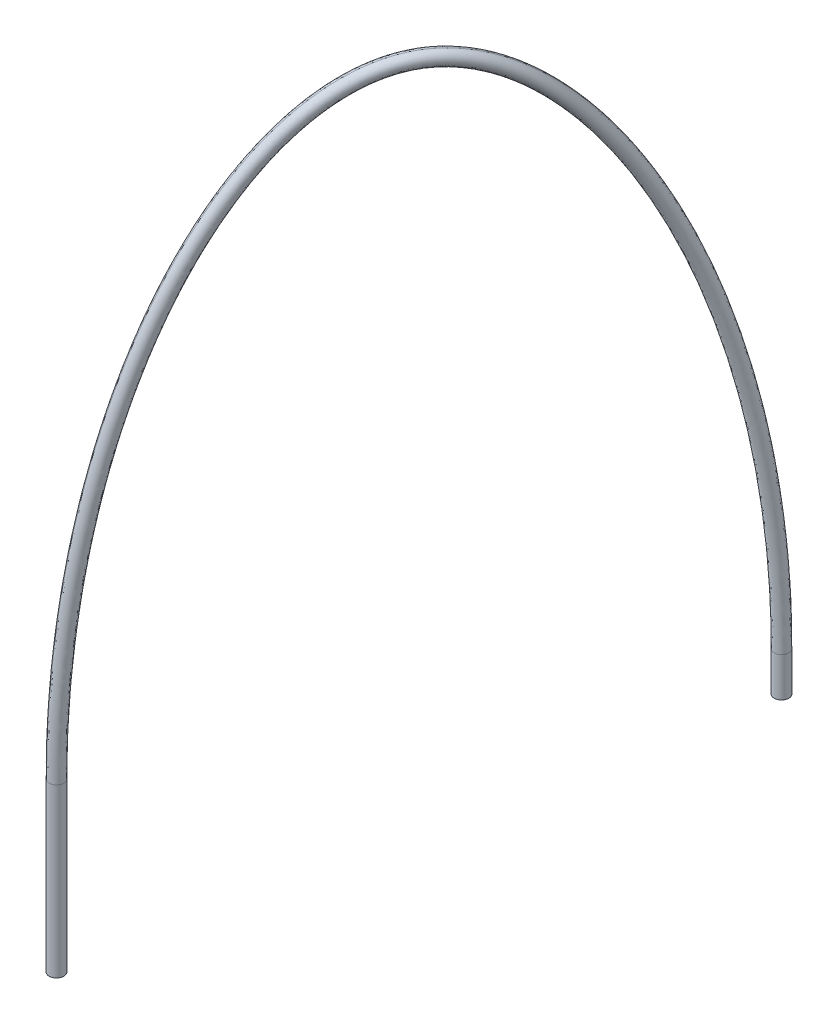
ISO-10303-21;
HEADER;
FILE_DESCRIPTION(('STEP AP214'),'2;1');
FILE_NAME('part.step','',(''),(''),'','','');
FILE_SCHEMA(('AUTOMOTIVE_DESIGN { 1 0 10303 214 1 1 1 1 }'));
ENDSEC;
DATA;
#1=APPLICATION_CONTEXT('core data for automotive mechanical design processes');
#2=APPLICATION_PROTOCOL_DEFINITION('international standard','automotive_design',2000,#1);
#3=PRODUCT_CONTEXT('',#1,'mechanical');
#4=PRODUCT('Part','Part','',(#3));
#5=PRODUCT_RELATED_PRODUCT_CATEGORY('part','',(#4));
#6=PRODUCT_DEFINITION_FORMATION('','',#4);
#7=PRODUCT_DEFINITION_CONTEXT('part definition',#1,'design');
#8=PRODUCT_DEFINITION('design','',#6,#7);
#9=PRODUCT_DEFINITION_SHAPE('','',#8);
#10=(LENGTH_UNIT() NAMED_UNIT(*) SI_UNIT(.MILLI.,.METRE.));
#11=(NAMED_UNIT(*) PLANE_ANGLE_UNIT() SI_UNIT($,.RADIAN.));
#12=(NAMED_UNIT(*) SI_UNIT($,.STERADIAN.) SOLID_ANGLE_UNIT());
#13=UNCERTAINTY_MEASURE_WITH_UNIT(LENGTH_MEASURE(1.E-05),#10,'distance_accuracy_value','');
#14=(GEOMETRIC_REPRESENTATION_CONTEXT(3) GLOBAL_UNCERTAINTY_ASSIGNED_CONTEXT((#13)) GLOBAL_UNIT_ASSIGNED_CONTEXT((#10,
#11,#12)) REPRESENTATION_CONTEXT('',''));
#15=CARTESIAN_POINT('',(0.,0.,0.));
#16=DIRECTION('',(0.,0.,1.));
#17=DIRECTION('',(1.,0.,0.));
#18=AXIS2_PLACEMENT_3D('',#15,#16,#17);
#19=CARTESIAN_POINT('',(6.782878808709,382.5607477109,-57.79062630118));
#20=CARTESIAN_POINT('',(6.77213882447,384.3785140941,-57.77300048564));
#21=CARTESIAN_POINT('',(6.678942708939,416.062686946,-57.62002894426));
#22=CARTESIAN_POINT('',(8.966811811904,461.0824515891,-61.37577512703));
#23=CARTESIAN_POINT('',(15.54190880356,513.1589527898,-72.16950349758));
#24=CARTESIAN_POINT('',(22.25880892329,548.364062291,-83.19596370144));
#25=CARTESIAN_POINT('',(30.52195583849,578.518913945,-96.76080121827));
#26=CARTESIAN_POINT('',(39.82670841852,601.7494682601,-112.0355158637));
#27=CARTESIAN_POINT('',(48.43447276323,614.6823769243,-126.1660465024));
#28=CARTESIAN_POINT('',(55.68700985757,620.4561851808,-138.0718586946));
#29=CARTESIAN_POINT('',(60.85133170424,621.987396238,-146.549629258));
#30=CARTESIAN_POINT('',(65.7113914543,621.2132537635,-154.5279216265));
#31=CARTESIAN_POINT('',(71.74782835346,617.9698993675,-164.4373884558));
#32=CARTESIAN_POINT('',(79.52008600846,609.149675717,-177.196314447));
#33=CARTESIAN_POINT('',(88.80693420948,590.8588686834,-192.4416569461));
#34=CARTESIAN_POINT('',(97.30904720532,565.6048697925,-206.3987767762));
#35=CARTESIAN_POINT('',(104.8386196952,533.3064931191,-218.7593164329));
#36=CARTESIAN_POINT('',(113.0328769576,481.3229939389,-232.2110780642));
#37=CARTESIAN_POINT('',(116.1986066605,431.4432460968,-237.4079694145));
#38=CARTESIAN_POINT('',(116.0857204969,394.4542765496,-237.2226271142));
#39=CARTESIAN_POINT('',(116.0744935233,392.6215805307,-237.2041907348));
#40=CARTESIAN_POINT('',(5.655577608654,382.5642783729,-58.84144318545));
#41=CARTESIAN_POINT('',(5.644851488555,384.3808657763,-58.82382355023));
#42=CARTESIAN_POINT('',(5.551741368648,416.0444745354,-58.67092806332));
#43=CARTESIAN_POINT('',(7.838166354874,461.0344663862,-62.42440060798));
#44=CARTESIAN_POINT('',(14.40817484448,513.0696652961,-73.20970256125));
#45=CARTESIAN_POINT('',(21.11860556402,548.2401180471,-84.22564488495));
#46=CARTESIAN_POINT('',(29.37080905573,578.3537593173,-97.77244645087));
#47=CARTESIAN_POINT('',(38.65677615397,601.5347166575,-113.0163414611));
#48=CARTESIAN_POINT('',(47.23322685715,614.4160769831,-127.095503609));
#49=CARTESIAN_POINT('',(54.44343566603,620.1544936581,-138.9317718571));
#50=CARTESIAN_POINT('',(59.56917373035,621.6736761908,-147.3462081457));
#51=CARTESIAN_POINT('',(64.39250234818,620.9056130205,-155.2642084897));
#52=CARTESIAN_POINT('',(70.38975717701,617.6841816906,-165.1092638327));
#53=CARTESIAN_POINT('',(78.12655983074,608.9076713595,-177.8101339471));
#54=CARTESIAN_POINT('',(87.38872931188,590.6683917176,-193.0149167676));
#55=CARTESIAN_POINT('',(95.87659750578,565.4584922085,-206.9485990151));
#56=CARTESIAN_POINT('',(103.3971521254,533.19950596,-219.2944600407));
#57=CARTESIAN_POINT('',(111.5839626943,481.2649140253,-232.7338805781));
#58=CARTESIAN_POINT('',(114.7477329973,431.42096102,-237.9275008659));
#59=CARTESIAN_POINT('',(114.6348763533,394.4567177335,-237.7422998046));
#60=CARTESIAN_POINT('',(114.6236472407,392.6252430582,-237.7238803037));
#61=CARTESIAN_POINT('',(4.128869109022,382.5532247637,-58.63151774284));
#62=CARTESIAN_POINT('',(4.118128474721,384.3735032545,-58.61386115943));
#63=CARTESIAN_POINT('',(4.024862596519,416.1014929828,-58.46065844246));
#64=CARTESIAN_POINT('',(6.315639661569,461.1846959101,-62.22135217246));
#65=CARTESIAN_POINT('',(12.90170636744,513.3492018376,-73.03295749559));
#66=CARTESIAN_POINT('',(19.63221284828,548.6281561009,-84.08193724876));
#67=CARTESIAN_POINT('',(27.9188014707,578.8708166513,-97.68512925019));
#68=CARTESIAN_POINT('',(37.2635485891,602.2070495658,-113.0255325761));
#69=CARTESIAN_POINT('',(45.93797144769,615.2497946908,-127.2655548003));
#70=CARTESIAN_POINT('',(53.28079987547,621.099013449,-139.3194863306));
#71=CARTESIAN_POINT('',(58.52732524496,622.6558542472,-147.9322115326));
#72=CARTESIAN_POINT('',(63.46563936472,621.8687583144,-156.0389772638));
#73=CARTESIAN_POINT('',(69.58572023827,618.5786914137,-166.0855930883));
#74=CARTESIAN_POINT('',(77.43326701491,609.6653257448,-178.9683777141));
#75=CARTESIAN_POINT('',(86.77278120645,591.2647268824,-194.3000927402));
#76=CARTESIAN_POINT('',(95.30533907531,565.9167633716,-208.3070955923));
#77=CARTESIAN_POINT('',(102.8539082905,533.5344556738,-220.6990445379));
#78=CARTESIAN_POINT('',(111.0642357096,481.4467475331,-234.1769781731));
#79=CARTESIAN_POINT('',(114.2342353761,431.4907299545,-239.3807814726));
#80=CARTESIAN_POINT('',(114.1211246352,394.4490750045,-239.1952367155));
#81=CARTESIAN_POINT('',(114.1098666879,392.6137766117,-239.176786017));
#82=CARTESIAN_POINT('',(3.327179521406,382.5357279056,-57.31546080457));
#83=CARTESIAN_POINT('',(3.316406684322,384.3618490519,-57.29775135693));
#84=CARTESIAN_POINT('',(3.222858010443,416.1917479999,-57.14408440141));
#85=CARTESIAN_POINT('',(5.520578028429,461.4224955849,-60.91617571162));
#86=CARTESIAN_POINT('',(12.13202273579,513.7916827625,-71.76944166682));
#87=CARTESIAN_POINT('',(18.89436427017,549.2423850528,-82.87068197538));
#88=CARTESIAN_POINT('',(27.23534180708,579.6892713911,-96.56315904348));
#89=CARTESIAN_POINT('',(36.67314275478,603.2712914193,-112.0563199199));
#90=CARTESIAN_POINT('',(45.50266672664,616.569494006,-126.5509567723));
#91=CARTESIAN_POINT('',(53.05538785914,622.5941023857,-138.9494490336));
#92=CARTESIAN_POINT('',(58.49311134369,624.2105527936,-147.8760458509));
#93=CARTESIAN_POINT('',(63.61344037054,623.3933297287,-156.2816080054));
#94=CARTESIAN_POINT('',(69.92789358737,619.994618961,-166.6473062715));
#95=CARTESIAN_POINT('',(77.95082017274,610.8646237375,-179.8179951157));
#96=CARTESIAN_POINT('',(87.41273785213,592.2086712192,-195.3506482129));
#97=CARTESIAN_POINT('',(96.0160057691,566.6421649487,-209.4737289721));
#98=CARTESIAN_POINT('',(103.6089891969,534.0646506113,-221.9385884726));
#99=CARTESIAN_POINT('',(111.8564767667,481.7345734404,-235.4775243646));
#100=CARTESIAN_POINT('',(115.0363066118,431.6011678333,-240.6974649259));
#101=CARTESIAN_POINT('',(114.9228453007,394.4369772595,-240.5113446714));
#102=CARTESIAN_POINT('',(114.9115530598,392.5956262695,-240.4928376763));
#103=CARTESIAN_POINT('',(2.525489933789,382.5182310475,-55.99940386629));
#104=CARTESIAN_POINT('',(2.514684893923,384.3501948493,-55.98164155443));
#105=CARTESIAN_POINT('',(2.420853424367,416.2820030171,-55.82751036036));
#106=CARTESIAN_POINT('',(4.725516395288,461.6602952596,-59.61099925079));
#107=CARTESIAN_POINT('',(11.36233910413,514.2341636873,-70.50592583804));
#108=CARTESIAN_POINT('',(18.15651569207,549.8566140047,-81.659426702));
#109=CARTESIAN_POINT('',(26.55188214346,580.507726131,-95.44118883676));
#110=CARTESIAN_POINT('',(36.08273692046,604.3355332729,-111.0871072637));
#111=CARTESIAN_POINT('',(45.06736200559,617.8891933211,-125.8363587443));
#112=CARTESIAN_POINT('',(52.82997584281,624.0891913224,-138.5794117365));
#113=CARTESIAN_POINT('',(58.45889744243,625.7652513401,-147.8198801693));
#114=CARTESIAN_POINT('',(63.76124137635,624.917901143,-156.524238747));
#115=CARTESIAN_POINT('',(70.27006693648,621.4105465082,-167.2090194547));
#116=CARTESIAN_POINT('',(78.46837333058,612.0639217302,-180.6676125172));
#117=CARTESIAN_POINT('',(88.0526944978,593.152615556,-196.4012036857));
#118=CARTESIAN_POINT('',(96.72667246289,567.3675665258,-210.6403623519));
#119=CARTESIAN_POINT('',(104.3640701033,534.5948455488,-223.1781324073));
#120=CARTESIAN_POINT('',(112.6487178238,482.0223993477,-236.7780705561));
#121=CARTESIAN_POINT('',(115.8383778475,431.7116057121,-242.0141483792));
#122=CARTESIAN_POINT('',(115.7245659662,394.4248795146,-241.8274526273));
#123=CARTESIAN_POINT('',(115.7132394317,392.5774759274,-241.8088893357));
#124=CARTESIAN_POINT('',(3.039266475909,382.5071774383,-54.54649602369));
#125=CARTESIAN_POINT('',(3.028435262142,384.3428323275,-54.52870386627));
#126=CARTESIAN_POINT('',(2.934402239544,416.3390214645,-54.37429333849));
#127=CARTESIAN_POINT('',(5.24348552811,461.8105247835,-58.16496184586));
#128=CARTESIAN_POINT('',(11.89631503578,514.5137002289,-69.08622312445));
#129=CARTESIAN_POINT('',(18.71063933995,550.2446520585,-80.27271758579));
#130=CARTESIAN_POINT('',(27.14034086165,581.024783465,-94.11090065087));
#131=CARTESIAN_POINT('',(36.72998880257,605.0078661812,-109.8533193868));
#132=CARTESIAN_POINT('',(45.81261144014,618.7229110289,-124.7634154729));
#133=CARTESIAN_POINT('',(53.70780434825,625.0337111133,-137.7241564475));
#134=CARTESIAN_POINT('',(59.45751678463,626.7474293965,-147.1629116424));
#135=CARTESIAN_POINT('',(64.87485040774,625.8810464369,-156.0560330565));
#136=CARTESIAN_POINT('',(71.50643869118,622.3050562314,-166.9424128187));
#137=CARTESIAN_POINT('',(79.8155927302,612.8215761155,-180.5828573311));
#138=CARTESIAN_POINT('',(89.47722556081,593.7489507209,-196.4434008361));
#139=CARTESIAN_POINT('',(98.19585574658,567.8258376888,-210.7559029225));
#140=CARTESIAN_POINT('',(105.861355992,534.9297952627,-223.3397072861));
#141=CARTESIAN_POINT('',(114.169438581,482.2042328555,-236.9782084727));
#142=CARTESIAN_POINT('',(117.3652896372,431.7813746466,-242.2244926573));
#143=CARTESIAN_POINT('',(117.2512889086,394.4172367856,-242.0374134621));
#144=CARTESIAN_POINT('',(117.239947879,392.5660094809,-242.0188102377));
#145=CARTESIAN_POINT('',(4.490110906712,382.5107081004,-54.02680904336));
#146=CARTESIAN_POINT('',(4.479278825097,384.3451840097,-54.00903204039));
#147=CARTESIAN_POINT('',(4.385273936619,416.3208090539,-53.854732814));
#148=CARTESIAN_POINT('',(6.692999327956,461.7625395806,-57.64307516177));
#149=CARTESIAN_POINT('',(13.34067536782,514.4244127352,-68.55594959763));
#150=CARTESIAN_POINT('',(20.14862118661,550.1207078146,-79.73187079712));
#151=CARTESIAN_POINT('',(28.56731603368,580.8596288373,-93.55205644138));
#152=CARTESIAN_POINT('',(38.13819509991,604.7931145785,-109.2636454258));
#153=CARTESIAN_POINT('',(47.189536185,618.4566110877,-124.1223534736));
#154=CARTESIAN_POINT('',(55.04234957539,624.7320195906,-137.0135817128));
#155=CARTESIAN_POINT('',(60.75348269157,626.4337093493,-146.3889999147));
#156=CARTESIAN_POINT('',(66.13409047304,625.5734056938,-155.2218260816));
#157=CARTESIAN_POINT('',(72.72641667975,622.0193385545,-166.0438430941));
#158=CARTESIAN_POINT('',(81.00024651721,612.579571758,-179.6261520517));
#159=CARTESIAN_POINT('',(90.63715887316,593.5584737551,-195.4461613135));
#160=CARTESIAN_POINT('',(99.34149693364,567.6794601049,-209.7352546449));
#161=CARTESIAN_POINT('',(106.9980905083,534.8228081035,-222.3043126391));
#162=CARTESIAN_POINT('',(115.2986228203,482.1461529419,-235.9305358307));
#163=CARTESIAN_POINT('',(118.4924660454,431.7590895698,-241.1735784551));
#164=CARTESIAN_POINT('',(118.3785772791,394.4196779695,-240.9865902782));
#165=CARTESIAN_POINT('',(118.3672522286,392.5696720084,-240.9679928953));
#166=(BOUNDED_SURFACE() B_SPLINE_SURFACE(3,3,((#19,#20,#21,#22,#23,#24,#25,#26,#27,#28,#29,#30,
#31,#32,#33,#34,#35,#36,#37,#38,#39),(#40,#41,#42,#43,#44,#45,#46,#47,#48,#49,#50,#51,#52,#53,
#54,#55,#56,#57,#58,#59,#60),(#61,#62,#63,#64,#65,#66,#67,#68,#69,#70,#71,#72,#73,#74,#75,#76,
#77,#78,#79,#80,#81),(#82,#83,#84,#85,#86,#87,#88,#89,#90,#91,#92,#93,#94,#95,#96,#97,#98,#99,
#100,#101,#102),(#103,#104,#105,#106,#107,#108,#109,#110,#111,#112,#113,#114,#115,#116,#117,
#118,#119,#120,#121,#122,#123),(#124,#125,#126,#127,#128,#129,#130,#131,#132,#133,#134,#135,
#136,#137,#138,#139,#140,#141,#142,#143,#144),(#145,#146,#147,#148,#149,#150,#151,#152,#153,
#154,#155,#156,#157,#158,#159,#160,#161,#162,#163,#164,#165)),.UNSPECIFIED.,.F.,.F.,
.F.) B_SPLINE_SURFACE_WITH_KNOTS((4,3,4),(4,1,1,1,1,1,1,1,1,1,1,1,1,1,1,1,1,1,4),(0.,1.,2.),
(-0.00711840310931,0.,0.1172727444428,0.1782545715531,0.2443182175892,0.3053000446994,
0.3713636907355,0.4374273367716,0.4717804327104,0.5089962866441,0.5350608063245,0.5632973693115,
0.6221235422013,0.680949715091,0.7446780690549,0.8035042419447,0.8672325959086,1.,
1.006895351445),
.UNSPECIFIED.) GEOMETRIC_REPRESENTATION_ITEM() RATIONAL_B_SPLINE_SURFACE(((1.225679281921,
1.225679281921,1.225679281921,1.225679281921,1.225679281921,1.225679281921,1.225679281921,
1.225679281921,1.225679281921,1.225679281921,1.225679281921,1.225679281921,1.225679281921,
1.225679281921,1.225679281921,1.225679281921,1.225679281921,1.225679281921,1.225679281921,
1.225679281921,1.225679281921),(0.924773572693,0.924773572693,0.924773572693,0.924773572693,
0.924773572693,0.924773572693,0.924773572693,0.924773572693,0.9247735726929,0.924773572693,
0.924773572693,0.924773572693,0.9247735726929,0.924773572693,0.924773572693,0.924773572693,
0.9247735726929,0.924773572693,0.9247735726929,0.924773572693,0.924773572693),(0.924773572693,
0.924773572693,0.924773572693,0.924773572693,0.924773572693,0.924773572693,0.924773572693,
0.924773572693,0.9247735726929,0.924773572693,0.924773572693,0.924773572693,0.9247735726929,
0.924773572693,0.924773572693,0.924773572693,0.9247735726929,0.924773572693,0.9247735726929,
0.924773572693,0.924773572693),(1.225679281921,1.225679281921,1.225679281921,1.225679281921,
1.225679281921,1.225679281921,1.225679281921,1.225679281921,1.225679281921,1.225679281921,
1.225679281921,1.225679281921,1.225679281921,1.225679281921,1.225679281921,1.225679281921,
1.225679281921,1.225679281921,1.225679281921,1.225679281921,1.225679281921),(0.924773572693,
0.924773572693,0.924773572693,0.924773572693,0.924773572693,0.924773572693,0.924773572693,
0.924773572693,0.9247735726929,0.924773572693,0.924773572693,0.924773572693,0.9247735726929,
0.924773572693,0.924773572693,0.924773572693,0.9247735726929,0.924773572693,0.9247735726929,
0.924773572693,0.924773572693),(0.924773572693,0.924773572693,0.924773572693,0.924773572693,
0.924773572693,0.924773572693,0.924773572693,0.924773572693,0.9247735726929,0.924773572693,
0.924773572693,0.924773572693,0.9247735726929,0.924773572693,0.924773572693,0.924773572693,
0.9247735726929,0.924773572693,0.9247735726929,0.924773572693,0.924773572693),(1.225679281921,
1.225679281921,1.225679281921,1.225679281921,1.225679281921,1.225679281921,1.225679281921,
1.225679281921,1.225679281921,1.225679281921,1.225679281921,1.225679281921,1.225679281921,
1.225679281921,1.225679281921,1.225679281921,1.225679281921,1.225679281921,1.225679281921,
1.225679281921,1.225679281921))) REPRESENTATION_ITEM('') SURFACE());
#167=CARTESIAN_POINT('',(116.85,398.1,-239.35));
#168=DIRECTION('',(0.,-1.,0.));
#169=DIRECTION('',(0.,0.,-1.));
#170=AXIS2_PLACEMENT_3D('',#167,#168,#169);
#171=CIRCLE('',#170,2.25);
#172=CARTESIAN_POINT('',(115.679468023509,398.1,-237.428449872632));
#173=VERTEX_POINT('',#172);
#174=CARTESIAN_POINT('',(118.020531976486,398.1,-241.271550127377));
#175=VERTEX_POINT('',#174);
#176=EDGE_CURVE('E67',#173,#175,#171,.T.);
#177=CARTESIAN_POINT('',(4.07828394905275,382.510182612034,-54.2234851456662));
#178=CARTESIAN_POINT('',(4.06745311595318,384.344833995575,-54.2057052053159));
#179=CARTESIAN_POINT('',(3.97344843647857,416.323519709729,-54.0513867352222));
#180=CARTESIAN_POINT('',(6.28136938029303,461.769681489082,-57.8400792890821));
#181=CARTESIAN_POINT('',(12.9298173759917,514.437701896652,-68.7541989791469));
#182=CARTESIAN_POINT('',(19.738705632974,550.139155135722,-79.9316980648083));
#183=CARTESIAN_POINT('',(28.1590434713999,580.884209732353,-93.7545594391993));
#184=CARTESIAN_POINT('',(37.7327147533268,604.825077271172,-109.470737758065));
#185=CARTESIAN_POINT('',(46.7887092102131,618.49624601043,-124.337095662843));
#186=CARTESIAN_POINT('',(54.6478340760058,624.776922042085,-137.238667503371));
#187=CARTESIAN_POINT('',(60.3647088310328,626.480402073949,-146.623512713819));
#188=CARTESIAN_POINT('',(65.7507823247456,625.619193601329,-155.465313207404));
#189=CARTESIAN_POINT('',(72.3489582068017,622.061863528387,-166.296905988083));
#190=CARTESIAN_POINT('',(80.6280356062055,612.615590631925,-179.887873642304));
#191=CARTESIAN_POINT('',(90.2686304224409,593.586823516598,-195.713913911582));
#192=CARTESIAN_POINT('',(98.9750992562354,567.701246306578,-210.006489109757));
#193=CARTESIAN_POINT('',(106.633010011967,534.838731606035,-222.577747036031));
#194=CARTESIAN_POINT('',(114.934673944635,482.154797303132,-236.205792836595));
#195=CARTESIAN_POINT('',(118.128819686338,431.762406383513,-241.449315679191));
#196=CARTESIAN_POINT('',(118.014907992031,394.419314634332,-241.262317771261));
#197=CARTESIAN_POINT('',(118.003579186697,392.569126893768,-241.243720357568));
#198=(BOUNDED_CURVE() B_SPLINE_CURVE(3,(#177,#178,#179,#180,#181,#182,#183,#184,#185,#186,#187,
#188,#189,#190,#191,#192,#193,#194,#195,#196,#197),.UNSPECIFIED.,.F.,
.F.) B_SPLINE_CURVE_WITH_KNOTS((4,1,1,1,1,1,1,1,1,1,1,1,1,1,1,1,1,1,4),(-0.00711840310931,0.,
0.1172727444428,0.1782545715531,0.2443182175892,0.3053000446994,0.3713636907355,0.4374273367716,
0.4717804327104,0.5089962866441,0.5350608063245,0.5632973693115,0.6221235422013,0.680949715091,
0.7446780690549,0.8035042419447,0.8672325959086,1.,1.006895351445),
.UNSPECIFIED.) CURVE() GEOMETRIC_REPRESENTATION_ITEM() RATIONAL_B_SPLINE_CURVE((1.12665034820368,
1.12665034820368,1.12665034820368,1.12665034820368,1.12665034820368,1.12665034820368,
1.12665034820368,1.12665034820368,1.12665034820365,1.12665034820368,1.12665034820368,
1.12665034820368,1.12665034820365,1.12665034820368,1.12665034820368,1.12665034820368,
1.12665034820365,1.12665034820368,1.12665034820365,1.12665034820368,1.12665034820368)) REPRESENTATION_ITEM(''));
#199=CARTESIAN_POINT('',(4.06207360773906,387.999999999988,-54.1968741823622));
#200=VERTEX_POINT('',#199);
#201=EDGE_CURVE('E75',#175,#200,#198,.F.);
#202=CARTESIAN_POINT('',(5.232605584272,388.,-56.11842430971));
#203=DIRECTION('',(0.,1.,0.));
#204=DIRECTION('',(0.,0.,1.));
#205=AXIS2_PLACEMENT_3D('',#202,#203,#204);
#206=CIRCLE('',#205,2.25);
#207=CARTESIAN_POINT('',(6.40313756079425,388.,-58.0399744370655));
#208=VERTEX_POINT('',#207);
#209=EDGE_CURVE('E70',#200,#208,#206,.F.);
#210=CARTESIAN_POINT('',(6.41920661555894,382.561273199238,-58.0663534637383));
#211=CARTESIAN_POINT('',(6.40846981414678,384.378864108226,-58.0487278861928));
#212=CARTESIAN_POINT('',(6.31529089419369,416.05997629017,-57.8957649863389));
#213=CARTESIAN_POINT('',(8.60293851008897,461.075309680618,-61.6511767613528));
#214=CARTESIAN_POINT('',(15.1772830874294,513.145663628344,-72.4436479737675));
#215=CARTESIAN_POINT('',(21.8932134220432,548.345614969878,-83.4685469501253));
#216=CARTESIAN_POINT('',(30.1547363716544,578.494333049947,-97.0306971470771));
#217=CARTESIAN_POINT('',(39.4566917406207,601.717505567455,-112.30082550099));
#218=CARTESIAN_POINT('',(48.0597930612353,614.642742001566,-126.423712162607));
#219=CARTESIAN_POINT('',(55.3060340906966,620.411282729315,-138.319171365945));
#220=CARTESIAN_POINT('',(60.4646129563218,621.94070351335,-146.787515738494));
#221=CARTESIAN_POINT('',(65.3192054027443,621.167465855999,-154.7568347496));
#222=CARTESIAN_POINT('',(71.3498166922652,617.92737439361,-164.656711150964));
#223=CARTESIAN_POINT('',(79.1167874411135,609.113656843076,-177.407002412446));
#224=CARTESIAN_POINT('',(88.3999657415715,590.830518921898,-192.646306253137));
#225=CARTESIAN_POINT('',(96.8999621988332,565.583083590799,-206.59993554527));
#226=CARTESIAN_POINT('',(104.428184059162,533.290569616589,-218.958295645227));
#227=CARTESIAN_POINT('',(112.621340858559,481.314349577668,-232.408215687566));
#228=CARTESIAN_POINT('',(115.786782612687,431.439929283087,-237.604617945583));
#229=CARTESIAN_POINT('',(115.673894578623,394.454639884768,-237.419300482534));
#230=CARTESIAN_POINT('',(115.662665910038,392.622125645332,-237.400867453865));
#231=(BOUNDED_CURVE() B_SPLINE_CURVE(3,(#210,#211,#212,#213,#214,#215,#216,#217,#218,#219,#220,
#221,#222,#223,#224,#225,#226,#227,#228,#229,#230),.UNSPECIFIED.,.F.,
.F.) B_SPLINE_CURVE_WITH_KNOTS((4,1,1,1,1,1,1,1,1,1,1,1,1,1,1,1,1,1,4),(-0.00711840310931,0.,
0.1172727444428,0.1782545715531,0.2443182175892,0.3053000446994,0.3713636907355,0.4374273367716,
0.4717804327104,0.5089962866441,0.5350608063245,0.5632973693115,0.6221235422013,0.680949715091,
0.7446780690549,0.8035042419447,0.8672325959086,1.,1.006895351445),
.UNSPECIFIED.) CURVE() GEOMETRIC_REPRESENTATION_ITEM() RATIONAL_B_SPLINE_CURVE((1.12665034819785,
1.12665034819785,1.12665034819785,1.12665034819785,1.12665034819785,1.12665034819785,
1.12665034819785,1.12665034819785,1.12665034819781,1.12665034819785,1.12665034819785,
1.12665034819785,1.12665034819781,1.12665034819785,1.12665034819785,1.12665034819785,
1.12665034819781,1.12665034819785,1.12665034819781,1.12665034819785,1.12665034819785)) REPRESENTATION_ITEM(''));
#232=EDGE_CURVE('E64',#208,#173,#231,.T.);
#233=ORIENTED_EDGE('',*,*,#176,.T.);
#234=ORIENTED_EDGE('',*,*,#201,.T.);
#235=ORIENTED_EDGE('',*,*,#209,.T.);
#236=ORIENTED_EDGE('',*,*,#232,.T.);
#237=EDGE_LOOP('',(#233,#234,#235,#236));
#238=FACE_BOUND('',#237,.T.);
#239=ADVANCED_FACE('F17',(#238),#166,.F.);
#240=CARTESIAN_POINT('',(3.714611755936,382.5107081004,-54.49921230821));
#241=CARTESIAN_POINT('',(3.703784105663,384.3451840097,-54.48143260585));
#242=CARTESIAN_POINT('',(3.609796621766,416.3208090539,-54.32712277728));
#243=CARTESIAN_POINT('',(5.91749607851,461.7625395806,-58.11548092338));
#244=CARTESIAN_POINT('',(12.56519165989,514.4244127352,-69.02834345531));
#245=CARTESIAN_POINT('',(19.37311013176,550.1207078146,-80.20428131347));
#246=CARTESIAN_POINT('',(27.7918240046,580.8596288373,-94.02445536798));
#247=CARTESIAN_POINT('',(37.36269807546,604.7931145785,-109.7360473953));
#248=CARTESIAN_POINT('',(46.41402950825,618.4566110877,-124.594761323));
#249=CARTESIAN_POINT('',(54.26685830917,624.7320195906,-137.4859801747));
#250=CARTESIAN_POINT('',(59.97799008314,626.4337093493,-146.8613991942));
#251=CARTESIAN_POINT('',(65.35859627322,625.5734056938,-155.6942263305));
#252=CARTESIAN_POINT('',(71.95094654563,622.0193385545,-166.5162286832));
#253=CARTESIAN_POINT('',(80.22473703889,612.579571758,-180.0985616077));
#254=CARTESIAN_POINT('',(89.86166195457,593.5584737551,-195.9185632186));
#255=CARTESIAN_POINT('',(98.56601424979,567.6794601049,-210.2076478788));
#256=CARTESIAN_POINT('',(106.222574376,534.8228081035,-222.7767262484));
#257=CARTESIAN_POINT('',(114.5231378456,482.1461529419,-236.40293046));
#258=CARTESIAN_POINT('',(117.7169956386,431.7590895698,-241.6459642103));
#259=CARTESIAN_POINT('',(117.6030820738,394.4196779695,-241.4589911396));
#260=CARTESIAN_POINT('',(117.5917515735,392.5696720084,-241.4403970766));
#261=CARTESIAN_POINT('',(4.84191295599,382.5071774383,-53.44839542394));
#262=CARTESIAN_POINT('',(4.831071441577,384.3428323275,-53.43060954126));
#263=CARTESIAN_POINT('',(4.736997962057,416.3390214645,-53.27622365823));
#264=CARTESIAN_POINT('',(7.046141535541,461.8105247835,-57.06685544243));
#265=CARTESIAN_POINT('',(13.69892561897,514.5137002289,-67.98814439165));
#266=CARTESIAN_POINT('',(20.51331349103,550.2446520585,-79.17460012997));
#267=CARTESIAN_POINT('',(28.94297078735,581.024783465,-93.01281013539));
#268=CARTESIAN_POINT('',(38.53263034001,605.0078661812,-108.7552217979));
#269=CARTESIAN_POINT('',(47.61527541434,618.7229110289,-123.6653042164));
#270=CARTESIAN_POINT('',(55.51043250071,625.0337111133,-136.6260670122));
#271=CARTESIAN_POINT('',(61.26014805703,626.7474293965,-146.0648203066));
#272=CARTESIAN_POINT('',(66.67748537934,625.8810464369,-154.9579394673));
#273=CARTESIAN_POINT('',(73.30901772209,622.3050562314,-165.8443533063));
#274=CARTESIAN_POINT('',(81.61826321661,612.8215761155,-179.4847421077));
#275=CARTESIAN_POINT('',(91.27986685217,593.7489507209,-195.3453033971));
#276=CARTESIAN_POINT('',(99.99846394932,567.8258376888,-209.6578256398));
#277=CARTESIAN_POINT('',(107.6640419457,534.9297952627,-222.2415826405));
#278=CARTESIAN_POINT('',(115.9720521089,482.2042328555,-235.8801279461));
#279=CARTESIAN_POINT('',(119.1678693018,431.7813746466,-241.1264327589));
#280=CARTESIAN_POINT('',(119.0539262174,394.4172367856,-240.9393184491));
#281=CARTESIAN_POINT('',(119.042597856,392.5660094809,-240.9207075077));
#282=CARTESIAN_POINT('',(6.368621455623,382.5182310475,-53.65832086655));
#283=CARTESIAN_POINT('',(6.357794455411,384.3501948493,-53.64057193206));
#284=CARTESIAN_POINT('',(6.263876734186,416.2820030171,-53.48649327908));
#285=CARTESIAN_POINT('',(8.568668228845,461.6602952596,-57.26990387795));
#286=CARTESIAN_POINT('',(15.20539409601,514.2341636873,-68.1648894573));
#287=CARTESIAN_POINT('',(21.99970620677,549.8566140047,-79.31830776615));
#288=CARTESIAN_POINT('',(30.39497837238,580.507726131,-93.10012733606));
#289=CARTESIAN_POINT('',(39.92585790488,604.3355332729,-108.746030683));
#290=CARTESIAN_POINT('',(48.91053082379,617.8891933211,-123.4952530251));
#291=CARTESIAN_POINT('',(56.67306829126,624.0891913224,-136.2383525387));
#292=CARTESIAN_POINT('',(62.30199654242,625.7652513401,-145.4788169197));
#293=CARTESIAN_POINT('',(67.6043483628,624.917901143,-154.1831706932));
#294=CARTESIAN_POINT('',(74.11305466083,621.4105465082,-164.8680240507));
#295=CARTESIAN_POINT('',(82.31155603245,612.0639217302,-178.3264983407));
#296=CARTESIAN_POINT('',(91.89581495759,593.152615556,-194.0601274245));
#297=CARTESIAN_POINT('',(100.5697223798,567.3675665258,-208.2993290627));
#298=CARTESIAN_POINT('',(108.2072857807,534.5948455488,-220.8369981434));
#299=CARTESIAN_POINT('',(116.4917790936,482.0223993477,-234.4370303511));
#300=CARTESIAN_POINT('',(119.681366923,431.7116057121,-239.6731521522));
#301=CARTESIAN_POINT('',(119.5676779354,394.4248795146,-239.4863815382));
#302=CARTESIAN_POINT('',(119.5563784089,392.5774759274,-239.4678017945));
#303=CARTESIAN_POINT('',(7.170311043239,382.5357279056,-54.97437780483));
#304=CARTESIAN_POINT('',(7.15951624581,384.3618490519,-54.95668173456));
#305=CARTESIAN_POINT('',(7.065881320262,416.1917479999,-54.80306732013));
#306=CARTESIAN_POINT('',(9.363729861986,461.4224955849,-58.57508033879));
#307=CARTESIAN_POINT('',(15.97507772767,513.7916827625,-69.42840528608));
#308=CARTESIAN_POINT('',(22.73755478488,549.2423850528,-80.52956303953));
#309=CARTESIAN_POINT('',(31.078438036,579.6892713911,-94.22209754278));
#310=CARTESIAN_POINT('',(40.5162637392,603.2712914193,-109.7152433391));
#311=CARTESIAN_POINT('',(49.34583554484,616.569494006,-124.2098510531));
#312=CARTESIAN_POINT('',(56.8984803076,622.5941023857,-136.6083898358));
#313=CARTESIAN_POINT('',(62.33621044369,624.2105527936,-145.5349826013));
#314=CARTESIAN_POINT('',(67.45654735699,623.3933297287,-153.9405399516));
#315=CARTESIAN_POINT('',(73.77088131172,619.994618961,-164.3063108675));
#316=CARTESIAN_POINT('',(81.79400287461,610.8646237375,-177.4768809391));
#317=CARTESIAN_POINT('',(91.25585831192,592.2086712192,-193.0095719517));
#318=CARTESIAN_POINT('',(99.859055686,566.6421649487,-207.1326956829));
#319=CARTESIAN_POINT('',(107.4522048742,534.0646506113,-219.5974542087));
#320=CARTESIAN_POINT('',(115.6995380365,481.7345734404,-233.1364841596));
#321=CARTESIAN_POINT('',(118.8792956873,431.6011678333,-238.3564686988));
#322=CARTESIAN_POINT('',(118.7659572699,394.4369772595,-238.1702735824));
#323=CARTESIAN_POINT('',(118.7546920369,392.5956262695,-238.1517501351));
#324=CARTESIAN_POINT('',(7.972000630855,382.5532247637,-56.2904347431));
#325=CARTESIAN_POINT('',(7.961238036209,384.3735032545,-56.27279153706));
#326=CARTESIAN_POINT('',(7.867885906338,416.1014929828,-56.11964136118));
#327=CARTESIAN_POINT('',(10.15879149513,461.1846959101,-59.88025679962));
#328=CARTESIAN_POINT('',(16.74476135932,513.3492018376,-70.69192111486));
#329=CARTESIAN_POINT('',(23.47540336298,548.6281561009,-81.74081831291));
#330=CARTESIAN_POINT('',(31.76189769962,578.8708166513,-95.34406774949));
#331=CARTESIAN_POINT('',(41.10666957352,602.2070495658,-110.6844559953));
#332=CARTESIAN_POINT('',(49.78114026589,615.2497946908,-124.9244490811));
#333=CARTESIAN_POINT('',(57.12389232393,621.099013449,-136.9784271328));
#334=CARTESIAN_POINT('',(62.37042434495,622.6558542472,-145.5911482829));
#335=CARTESIAN_POINT('',(67.30874635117,621.8687583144,-153.69790921));
#336=CARTESIAN_POINT('',(73.42870796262,618.5786914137,-163.7445976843));
#337=CARTESIAN_POINT('',(81.27644971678,609.6653257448,-176.6272635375));
#338=CARTESIAN_POINT('',(90.61590166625,591.2647268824,-191.959016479));
#339=CARTESIAN_POINT('',(99.14838899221,565.9167633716,-205.966062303));
#340=CARTESIAN_POINT('',(106.6971239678,533.5344556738,-218.357910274));
#341=CARTESIAN_POINT('',(114.9072969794,481.4467475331,-231.8359379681));
#342=CARTESIAN_POINT('',(118.0772244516,431.4907299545,-237.0397852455));
#343=CARTESIAN_POINT('',(117.9642366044,394.4490750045,-236.8541656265));
#344=CARTESIAN_POINT('',(117.953005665,392.6137766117,-236.8356984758));
#345=CARTESIAN_POINT('',(7.458224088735,382.5642783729,-57.7433425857));
#346=CARTESIAN_POINT('',(7.44748766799,384.3808657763,-57.72572922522));
#347=CARTESIAN_POINT('',(7.354337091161,416.0444745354,-57.57285838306));
#348=CARTESIAN_POINT('',(9.640822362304,461.0344663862,-61.32629420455));
#349=CARTESIAN_POINT('',(16.21078542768,513.0696652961,-72.11162382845));
#350=CARTESIAN_POINT('',(22.9212797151,548.2401180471,-83.12752742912));
#351=CARTESIAN_POINT('',(31.17343898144,578.3537593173,-96.67435593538));
#352=CARTESIAN_POINT('',(40.45941769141,601.5347166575,-111.9182438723));
#353=CARTESIAN_POINT('',(49.03589083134,614.4160769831,-125.9973923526));
#354=CARTESIAN_POINT('',(56.24606381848,620.1544936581,-137.8336824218));
#355=CARTESIAN_POINT('',(61.37180500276,621.6736761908,-146.2481168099));
#356=CARTESIAN_POINT('',(66.19513731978,620.9056130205,-154.1661149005));
#357=CARTESIAN_POINT('',(72.19233620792,617.6841816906,-164.0112043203));
#358=CARTESIAN_POINT('',(79.92923031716,608.9076713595,-176.7120187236));
#359=CARTESIAN_POINT('',(89.19137060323,590.6683917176,-191.9168193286));
#360=CARTESIAN_POINT('',(97.67920570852,565.4584922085,-205.8505217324));
#361=CARTESIAN_POINT('',(105.1998380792,533.19950596,-218.1963353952));
#362=CARTESIAN_POINT('',(113.3865762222,481.2649140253,-231.6358000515));
#363=CARTESIAN_POINT('',(116.5503126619,431.42096102,-236.8294409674));
#364=CARTESIAN_POINT('',(116.4375136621,394.4567177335,-236.6442047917));
#365=CARTESIAN_POINT('',(116.4262972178,392.6252430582,-236.6257775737));
#366=CARTESIAN_POINT('',(6.007379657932,382.5607477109,-58.26302956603));
#367=CARTESIAN_POINT('',(5.996644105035,384.3785140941,-58.2454010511));
#368=CARTESIAN_POINT('',(5.903465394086,416.062686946,-58.09241890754));
#369=CARTESIAN_POINT('',(8.191308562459,461.0824515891,-61.84818088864));
#370=CARTESIAN_POINT('',(14.76642509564,513.1589527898,-72.64189735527));
#371=CARTESIAN_POINT('',(21.48329786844,548.364062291,-83.66837421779));
#372=CARTESIAN_POINT('',(29.74646380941,578.518913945,-97.23320014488));
#373=CARTESIAN_POINT('',(39.05121139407,601.7494682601,-112.5079178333));
#374=CARTESIAN_POINT('',(47.65896608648,614.6823769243,-126.6384543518));
#375=CARTESIAN_POINT('',(54.91151859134,620.4561851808,-138.5442571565));
#376=CARTESIAN_POINT('',(60.07583909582,621.987396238,-147.0220285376));
#377=CARTESIAN_POINT('',(64.93589725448,621.2132537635,-155.0003218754));
#378=CARTESIAN_POINT('',(70.97235821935,617.9698993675,-164.9097740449));
#379=CARTESIAN_POINT('',(78.74457653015,609.149675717,-177.668724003));
#380=CARTESIAN_POINT('',(88.03143729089,590.8588686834,-192.9140588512));
#381=CARTESIAN_POINT('',(96.53356452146,565.6048697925,-206.8711700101));
#382=CARTESIAN_POINT('',(104.0631035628,533.3064931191,-219.2317300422));
#383=CARTESIAN_POINT('',(112.2573919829,481.3229939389,-232.6834726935));
#384=CARTESIAN_POINT('',(115.4231362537,431.4432460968,-237.8803551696));
#385=CARTESIAN_POINT('',(115.3102252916,394.4542765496,-237.6950279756));
#386=CARTESIAN_POINT('',(115.2989928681,392.6215805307,-237.6765949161));
#387=(BOUNDED_SURFACE() B_SPLINE_SURFACE(3,3,((#240,#241,#242,#243,#244,#245,#246,#247,#248,
#249,#250,#251,#252,#253,#254,#255,#256,#257,#258,#259,#260),(#261,#262,#263,#264,#265,#266,
#267,#268,#269,#270,#271,#272,#273,#274,#275,#276,#277,#278,#279,#280,#281),(#282,#283,#284,
#285,#286,#287,#288,#289,#290,#291,#292,#293,#294,#295,#296,#297,#298,#299,#300,#301,#302),
(#303,#304,#305,#306,#307,#308,#309,#310,#311,#312,#313,#314,#315,#316,#317,#318,#319,#320,#321,
#322,#323),(#324,#325,#326,#327,#328,#329,#330,#331,#332,#333,#334,#335,#336,#337,#338,#339,
#340,#341,#342,#343,#344),(#345,#346,#347,#348,#349,#350,#351,#352,#353,#354,#355,#356,#357,
#358,#359,#360,#361,#362,#363,#364,#365),(#366,#367,#368,#369,#370,#371,#372,#373,#374,#375,
#376,#377,#378,#379,#380,#381,#382,#383,#384,#385,#386)),.UNSPECIFIED.,.F.,.F.,
.F.) B_SPLINE_SURFACE_WITH_KNOTS((4,3,4),(4,1,1,1,1,1,1,1,1,1,1,1,1,1,1,1,1,1,4),(0.,1.,2.),
(-0.00711840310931,0.,0.1172727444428,0.1782545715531,0.2443182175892,0.3053000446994,
0.3713636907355,0.4374273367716,0.4717804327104,0.5089962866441,0.5350608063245,0.5632973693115,
0.6221235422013,0.680949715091,0.7446780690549,0.8035042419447,0.8672325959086,1.,
1.006895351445),
.UNSPECIFIED.) GEOMETRIC_REPRESENTATION_ITEM() RATIONAL_B_SPLINE_SURFACE(((1.225679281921,
1.225679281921,1.225679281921,1.225679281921,1.225679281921,1.225679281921,1.225679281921,
1.225679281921,1.225679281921,1.225679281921,1.225679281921,1.225679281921,1.225679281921,
1.225679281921,1.225679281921,1.225679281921,1.225679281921,1.225679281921,1.225679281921,
1.225679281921,1.225679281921),(0.924773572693,0.924773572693,0.924773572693,0.924773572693,
0.924773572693,0.924773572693,0.924773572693,0.924773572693,0.9247735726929,0.924773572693,
0.924773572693,0.924773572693,0.9247735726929,0.924773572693,0.924773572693,0.924773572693,
0.9247735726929,0.924773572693,0.9247735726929,0.924773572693,0.924773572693),(0.924773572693,
0.924773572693,0.924773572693,0.924773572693,0.924773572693,0.924773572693,0.924773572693,
0.924773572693,0.9247735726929,0.924773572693,0.924773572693,0.924773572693,0.9247735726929,
0.924773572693,0.924773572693,0.924773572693,0.9247735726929,0.924773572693,0.9247735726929,
0.924773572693,0.924773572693),(1.225679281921,1.225679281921,1.225679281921,1.225679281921,
1.225679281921,1.225679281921,1.225679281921,1.225679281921,1.225679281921,1.225679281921,
1.225679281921,1.225679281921,1.225679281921,1.225679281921,1.225679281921,1.225679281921,
1.225679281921,1.225679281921,1.225679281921,1.225679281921,1.225679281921),(0.924773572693,
0.924773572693,0.924773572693,0.924773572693,0.924773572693,0.924773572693,0.924773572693,
0.924773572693,0.9247735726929,0.924773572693,0.924773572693,0.924773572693,0.9247735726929,
0.924773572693,0.924773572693,0.924773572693,0.9247735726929,0.924773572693,0.9247735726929,
0.924773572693,0.924773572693),(0.924773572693,0.924773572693,0.924773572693,0.924773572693,
0.924773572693,0.924773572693,0.924773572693,0.924773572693,0.9247735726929,0.924773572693,
0.924773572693,0.924773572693,0.9247735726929,0.924773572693,0.924773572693,0.924773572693,
0.9247735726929,0.924773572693,0.9247735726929,0.924773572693,0.924773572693),(1.225679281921,
1.225679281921,1.225679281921,1.225679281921,1.225679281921,1.225679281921,1.225679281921,
1.225679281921,1.225679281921,1.225679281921,1.225679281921,1.225679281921,1.225679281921,
1.225679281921,1.225679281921,1.225679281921,1.225679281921,1.225679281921,1.225679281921,
1.225679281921,1.225679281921))) REPRESENTATION_ITEM('') SURFACE());
#388=CARTESIAN_POINT('',(116.85,398.1,-239.35));
#389=DIRECTION('',(0.,-1.,0.));
#390=DIRECTION('',(0.,0.,-1.));
#391=AXIS2_PLACEMENT_3D('',#388,#389,#390);
#392=CIRCLE('',#391,2.25);
#393=EDGE_CURVE('E77',#175,#173,#392,.T.);
#394=CARTESIAN_POINT('',(5.232605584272,388.,-56.11842430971));
#395=DIRECTION('',(0.,1.,0.));
#396=DIRECTION('',(0.,0.,1.));
#397=AXIS2_PLACEMENT_3D('',#394,#395,#396);
#398=CIRCLE('',#397,2.25);
#399=EDGE_CURVE('E84',#208,#200,#398,.F.);
#400=ORIENTED_EDGE('',*,*,#393,.T.);
#401=ORIENTED_EDGE('',*,*,#232,.F.);
#402=ORIENTED_EDGE('',*,*,#399,.T.);
#403=ORIENTED_EDGE('',*,*,#201,.F.);
#404=EDGE_LOOP('',(#400,#401,#402,#403));
#405=FACE_BOUND('',#404,.T.);
#406=ADVANCED_FACE('F78',(#405),#387,.F.);
#407=CARTESIAN_POINT('',(116.85,398.1,-239.35));
#408=DIRECTION('',(0.,-1.,0.));
#409=DIRECTION('',(0.,0.,-1.));
#410=AXIS2_PLACEMENT_3D('',#407,#408,#409);
#411=CYLINDRICAL_SURFACE('',#410,2.25);
#412=CARTESIAN_POINT('',(116.85,382.1,-239.35));
#413=DIRECTION('',(0.,-1.,0.));
#414=DIRECTION('',(0.,0.,-1.));
#415=AXIS2_PLACEMENT_3D('',#412,#413,#414);
#416=CIRCLE('',#415,2.25);
#417=CARTESIAN_POINT('',(116.85,382.1,-241.6));
#418=VERTEX_POINT('',#417);
#419=EDGE_CURVE('E22',#418,#418,#416,.F.);
#420=ORIENTED_EDGE('',*,*,#419,.F.);
#421=EDGE_LOOP('',(#420));
#422=FACE_BOUND('',#421,.T.);
#423=ORIENTED_EDGE('',*,*,#393,.F.);
#424=ORIENTED_EDGE('',*,*,#176,.F.);
#425=EDGE_LOOP('',(#423,#424));
#426=FACE_BOUND('',#425,.T.);
#427=ADVANCED_FACE('F81',(#422,#426),#411,.F.);
#428=CARTESIAN_POINT('',(5.232605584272,320.,-56.11842430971));
#429=DIRECTION('',(0.,1.,0.));
#430=DIRECTION('',(0.,0.,1.));
#431=AXIS2_PLACEMENT_3D('',#428,#429,#430);
#432=CYLINDRICAL_SURFACE('',#431,2.25);
#433=ORIENTED_EDGE('',*,*,#399,.F.);
#434=ORIENTED_EDGE('',*,*,#209,.F.);
#435=EDGE_LOOP('',(#433,#434));
#436=FACE_BOUND('',#435,.T.);
#437=CARTESIAN_POINT('',(5.232605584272,320.,-56.11842430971));
#438=DIRECTION('',(0.,1.,0.));
#439=DIRECTION('',(0.,0.,1.));
#440=AXIS2_PLACEMENT_3D('',#437,#438,#439);
#441=CIRCLE('',#440,2.25);
#442=CARTESIAN_POINT('',(5.232605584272,320.,-53.86842430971));
#443=VERTEX_POINT('',#442);
#444=EDGE_CURVE('E99',#443,#443,#441,.F.);
#445=ORIENTED_EDGE('',*,*,#444,.T.);
#446=EDGE_LOOP('',(#445));
#447=FACE_BOUND('',#446,.T.);
#448=ADVANCED_FACE('F238',(#436,#447),#432,.F.);
#449=CARTESIAN_POINT('',(116.85,382.1,-239.35));
#450=DIRECTION('',(0.,-1.,0.));
#451=DIRECTION('',(0.,0.,-1.));
#452=AXIS2_PLACEMENT_3D('',#449,#450,#451);
#453=PLANE('',#452);
#454=ORIENTED_EDGE('',*,*,#419,.T.);
#455=EDGE_LOOP('',(#454));
#456=FACE_BOUND('',#455,.T.);
#457=CARTESIAN_POINT('',(116.85,382.1,-239.35));
#458=DIRECTION('',(0.,-1.,0.));
#459=DIRECTION('',(0.,0.,-1.));
#460=AXIS2_PLACEMENT_3D('',#457,#458,#459);
#461=CIRCLE('',#460,3.);
#462=CARTESIAN_POINT('',(116.85,382.1,-242.35));
#463=VERTEX_POINT('',#462);
#464=EDGE_CURVE('E96',#463,#463,#461,.F.);
#465=ORIENTED_EDGE('',*,*,#464,.F.);
#466=EDGE_LOOP('',(#465));
#467=FACE_BOUND('',#466,.T.);
#468=ADVANCED_FACE('F230',(#456,#467),#453,.T.);
#469=CARTESIAN_POINT('',(5.232605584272,320.,-56.11842430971));
#470=DIRECTION('',(0.,1.,0.));
#471=DIRECTION('',(0.,0.,1.));
#472=AXIS2_PLACEMENT_3D('',#469,#470,#471);
#473=PLANE('',#472);
#474=ORIENTED_EDGE('',*,*,#444,.F.);
#475=EDGE_LOOP('',(#474));
#476=FACE_BOUND('',#475,.T.);
#477=CARTESIAN_POINT('',(5.232605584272,320.,-56.11842430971));
#478=DIRECTION('',(0.,1.,0.));
#479=DIRECTION('',(0.,0.,1.));
#480=AXIS2_PLACEMENT_3D('',#477,#478,#479);
#481=CIRCLE('',#480,3.);
#482=CARTESIAN_POINT('',(5.232605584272,320.,-53.11842430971));
#483=VERTEX_POINT('',#482);
#484=EDGE_CURVE('E91',#483,#483,#481,.T.);
#485=ORIENTED_EDGE('',*,*,#484,.F.);
#486=EDGE_LOOP('',(#485));
#487=FACE_BOUND('',#486,.T.);
#488=ADVANCED_FACE('F179',(#476,#487),#473,.F.);
#489=CARTESIAN_POINT('',(116.85,398.1,-239.35));
#490=DIRECTION('',(0.,-1.,0.));
#491=DIRECTION('',(0.,0.,-1.));
#492=AXIS2_PLACEMENT_3D('',#489,#490,#491);
#493=CYLINDRICAL_SURFACE('',#492,3.);
#494=ORIENTED_EDGE('',*,*,#464,.T.);
#495=EDGE_LOOP('',(#494));
#496=FACE_BOUND('',#495,.T.);
#497=CARTESIAN_POINT('',(116.849999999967,398.099999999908,-239.349999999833));
#498=DIRECTION('',(1.59020267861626E-11,1.,-1.76596338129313E-11));
#499=DIRECTION('',(0.,1.76596338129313E-11,1.));
#500=AXIS2_PLACEMENT_3D('',#497,#498,#499);
#501=CIRCLE('',#500,2.99999999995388);
#502=CARTESIAN_POINT('',(118.410709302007,398.100000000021,-241.912066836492));
#503=VERTEX_POINT('',#502);
#504=CARTESIAN_POINT('',(115.289290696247,398.099999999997,-236.787933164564));
#505=VERTEX_POINT('',#504);
#506=EDGE_CURVE('E134',#503,#505,#501,.T.);
#507=ORIENTED_EDGE('',*,*,#506,.F.);
#508=CARTESIAN_POINT('',(116.849999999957,398.099999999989,-239.34999999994));
#509=DIRECTION('',(-2.01411071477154E-12,1.,2.51992849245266E-11));
#510=DIRECTION('',(0.,-2.51992849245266E-11,1.));
#511=AXIS2_PLACEMENT_3D('',#508,#509,#510);
#512=CIRCLE('',#511,3.00000000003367);
#513=EDGE_CURVE('E98',#505,#503,#512,.T.);
#514=ORIENTED_EDGE('',*,*,#513,.F.);
#515=EDGE_LOOP('',(#507,#514));
#516=FACE_BOUND('',#515,.T.);
#517=ADVANCED_FACE('F169',(#496,#516),#493,.T.);
#518=CARTESIAN_POINT('',(3.317294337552,382.5020622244,-53.8496111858));
#519=CARTESIAN_POINT('',(3.306450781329,384.3394252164,-53.8318053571));
#520=CARTESIAN_POINT('',(3.212323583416,416.3654075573,-53.67726611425));
#521=CARTESIAN_POINT('',(5.523453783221,461.8800456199,-57.4712562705));
#522=CARTESIAN_POINT('',(12.18368964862,514.6430597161,-68.40470491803));
#523=CARTESIAN_POINT('',(19.00733901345,550.4242221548,-79.60646676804));
#524=CARTESIAN_POINT('',(27.45292858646,581.2640590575,-93.47076001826));
#525=CARTESIAN_POINT('',(37.06978415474,605.3189977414,-109.2578354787));
#526=CARTESIAN_POINT('',(46.19775704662,619.108725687,-124.242364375));
#527=CARTESIAN_POINT('',(54.15430199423,625.4708010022,-137.303844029));
#528=CARTESIAN_POINT('',(59.959912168,627.2019461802,-146.8343591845));
#529=CARTESIAN_POINT('',(65.43045897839,626.3267555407,-155.8148332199));
#530=CARTESIAN_POINT('',(72.11885619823,622.7190032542,-166.7945065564));
#531=CARTESIAN_POINT('',(80.47930859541,613.1721913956,-180.5191041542));
#532=CARTESIAN_POINT('',(90.17671783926,594.0249132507,-196.4383970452));
#533=CARTESIAN_POINT('',(98.91601073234,568.0379091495,-210.7848402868));
#534=CARTESIAN_POINT('',(106.5945175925,535.084797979,-223.3899466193));
#535=CARTESIAN_POINT('',(114.9134433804,482.2883788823,-237.0462943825));
#536=CARTESIAN_POINT('',(118.1121586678,431.8136612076,-242.2973021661));
#537=CARTESIAN_POINT('',(117.9980718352,394.4137000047,-242.1100447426));
#538=CARTESIAN_POINT('',(117.9867243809,392.5607032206,-242.0914228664));
#539=CARTESIAN_POINT('',(4.830465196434,382.4986539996,-52.57636454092));
#540=CARTESIAN_POINT('',(4.819605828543,384.3371550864,-52.55855422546));
#541=CARTESIAN_POINT('',(4.725386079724,416.3829883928,-52.40394737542));
#542=CARTESIAN_POINT('',(7.037924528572,461.9263667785,-56.20012366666));
#543=CARTESIAN_POINT('',(13.70306172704,514.7292508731,-67.141713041));
#544=CARTESIAN_POINT('',(20.53297113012,550.5438682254,-78.35361890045));
#545=CARTESIAN_POINT('',(28.98911420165,581.4234864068,-92.23532899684));
#546=CARTESIAN_POINT('',(38.62410654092,605.5263021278,-108.052153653));
#547=CARTESIAN_POINT('',(47.78231246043,619.3657908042,-123.0862664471));
#548=CARTESIAN_POINT('',(55.7797093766,625.7620303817,-136.2148835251));
#549=CARTESIAN_POINT('',(61.62256604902,627.5047869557,-145.8065361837));
#550=CARTESIAN_POINT('',(67.1285710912,626.6237278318,-154.8452108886));
#551=CARTESIAN_POINT('',(73.8547784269,622.9948127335,-165.8870700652));
#552=CARTESIAN_POINT('',(82.24947786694,613.4058034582,-179.6676971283));
#553=CARTESIAN_POINT('',(91.97070313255,594.208784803,-195.6261473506));
#554=CARTESIAN_POINT('',(100.7237390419,568.1792106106,-209.9952201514));
#555=CARTESIAN_POINT('',(108.4109693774,535.1880750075,-222.6144849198));
#556=CARTESIAN_POINT('',(116.7370665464,482.3444446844,-236.2827562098));
#557=CARTESIAN_POINT('',(119.937665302,431.8351734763,-241.5369264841));
#558=CARTESIAN_POINT('',(119.8235635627,394.4113434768,-241.3495244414));
#559=CARTESIAN_POINT('',(119.8122211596,392.5571677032,-241.3308844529));
#560=CARTESIAN_POINT('',(6.782089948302,382.5132756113,-52.89540852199));
#561=CARTESIAN_POINT('',(6.771250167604,384.346894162,-52.87764684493));
#562=CARTESIAN_POINT('',(6.677237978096,416.3075649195,-52.72344546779));
#563=CARTESIAN_POINT('',(8.984017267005,461.727644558,-56.51007102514));
#564=CARTESIAN_POINT('',(15.62791451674,514.3594825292,-67.41686550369));
#565=CARTESIAN_POINT('',(22.43126549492,550.0305750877,-78.58507121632));
#566=CARTESIAN_POINT('',(30.84192590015,580.739527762,-92.39218755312));
#567=CARTESIAN_POINT('',(40.39916413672,604.6369463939,-108.081352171));
#568=CARTESIAN_POINT('',(49.42777255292,618.2629567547,-122.9026812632));
#569=CARTESIAN_POINT('',(57.24974281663,624.5126283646,-135.743374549));
#570=CARTESIAN_POINT('',(62.9328230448,626.2055709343,-145.0727325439));
#571=CARTESIAN_POINT('',(68.28672619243,625.349688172,-153.8617102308));
#572=CARTESIAN_POINT('',(74.85046248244,621.81156357,-164.6369457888));
#573=CARTESIAN_POINT('',(83.09866717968,612.4035852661,-178.176940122));
#574=CARTESIAN_POINT('',(92.71758267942,593.419958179,-193.9674849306));
#575=CARTESIAN_POINT('',(101.4115047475,567.5730137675,-208.2395691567));
#576=CARTESIAN_POINT('',(109.0616747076,534.7450066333,-220.7978710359));
#577=CARTESIAN_POINT('',(117.356666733,482.1039170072,-234.4151958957));
#578=CARTESIAN_POINT('',(120.5490266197,431.7428837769,-239.6558953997));
#579=CARTESIAN_POINT('',(120.4352588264,394.4214532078,-239.4689493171));
#580=CARTESIAN_POINT('',(120.4239540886,392.5723354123,-239.4503508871));
#581=CARTESIAN_POINT('',(7.810832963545,382.5357279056,-54.58419730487));
#582=CARTESIAN_POINT('',(7.800034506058,384.3618490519,-54.56650346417));
#583=CARTESIAN_POINT('',(7.706385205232,416.1917479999,-54.41289780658));
#584=CARTESIAN_POINT('',(10.00425516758,461.4224955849,-58.18489777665));
#585=CARTESIAN_POINT('',(16.61558689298,513.7916827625,-69.03823255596));
#586=CARTESIAN_POINT('',(23.37808653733,549.2423850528,-80.13937655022));
#587=CARTESIAN_POINT('',(31.71895407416,579.6892713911,-93.83192062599));
#588=CARTESIAN_POINT('',(41.15678390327,603.2712914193,-109.325063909));
#589=CARTESIAN_POINT('',(49.98636368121,616.569494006,-123.8196667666));
#590=CARTESIAN_POINT('',(57.53899571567,622.5941023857,-136.2182133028));
#591=CARTESIAN_POINT('',(62.97672696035,624.2105527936,-145.144805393));
#592=CARTESIAN_POINT('',(68.09706518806,623.3933297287,-153.5503619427));
#593=CARTESIAN_POINT('',(74.41137926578,619.994618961,-163.9161449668));
#594=CARTESIAN_POINT('',(82.43453332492,610.8646237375,-177.086695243));
#595=CARTESIAN_POINT('',(91.89637838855,592.2086712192,-192.6193925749));
#596=CARTESIAN_POINT('',(100.4995640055,566.6421649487,-206.742523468));
#597=CARTESIAN_POINT('',(108.0927408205,534.0646506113,-219.2072651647));
#598=CARTESIAN_POINT('',(116.3400482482,481.7345734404,-232.7463107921));
#599=CARTESIAN_POINT('',(119.5197938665,431.6011678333,-237.966302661));
#600=CARTESIAN_POINT('',(119.4064759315,394.4369772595,-237.7800950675));
#601=CARTESIAN_POINT('',(119.3952151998,392.5956262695,-237.7615688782));
#602=CARTESIAN_POINT('',(8.839575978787,382.5581802,-56.27298608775));
#603=CARTESIAN_POINT('',(8.828818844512,384.3768039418,-56.2553600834));
#604=CARTESIAN_POINT('',(8.735532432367,416.0759310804,-56.10235014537));
#605=CARTESIAN_POINT('',(11.02449306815,461.1173466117,-59.85972452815));
#606=CARTESIAN_POINT('',(17.60325926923,513.2238829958,-70.65959960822));
#607=CARTESIAN_POINT('',(24.32490757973,548.4541950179,-81.69368188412));
#608=CARTESIAN_POINT('',(32.59598224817,578.6390150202,-95.27165369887));
#609=CARTESIAN_POINT('',(41.91440366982,601.9056364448,-110.568775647));
#610=CARTESIAN_POINT('',(50.5449548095,614.8760312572,-124.7366522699));
#611=CARTESIAN_POINT('',(57.82824861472,620.6755764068,-136.6930520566));
#612=CARTESIAN_POINT('',(63.0206308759,622.215534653,-145.2168782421));
#613=CARTESIAN_POINT('',(67.90740418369,621.4369712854,-153.2390136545));
#614=CARTESIAN_POINT('',(73.97229604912,618.1776743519,-163.1953441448));
#615=CARTESIAN_POINT('',(81.77039947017,609.3256622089,-175.9964503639));
#616=CARTESIAN_POINT('',(91.07517409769,590.9973842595,-191.2713002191));
#617=CARTESIAN_POINT('',(99.58762326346,565.7113161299,-205.2454777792));
#618=CARTESIAN_POINT('',(107.1238069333,533.3842945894,-217.6166592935));
#619=CARTESIAN_POINT('',(115.3234297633,481.3652298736,-231.0774256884));
#620=CARTESIAN_POINT('',(118.4905611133,431.4594518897,-236.2767099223));
#621=CARTESIAN_POINT('',(118.3776930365,394.4525013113,-236.0912408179));
#622=CARTESIAN_POINT('',(118.366476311,392.6189171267,-236.0727868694));
#623=CARTESIAN_POINT('',(8.227848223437,382.5728018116,-58.15352255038));
#624=CARTESIAN_POINT('',(8.217125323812,384.3865430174,-58.13593626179));
#625=CARTESIAN_POINT('',(8.124104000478,416.0005076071,-57.98329675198));
#626=CARTESIAN_POINT('',(10.40721975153,460.9186243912,-61.731172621));
#627=CARTESIAN_POINT('',(16.96481059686,512.8541146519,-72.4962134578));
#628=CARTESIAN_POINT('',(23.65981008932,547.9409018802,-83.48665065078));
#629=CARTESIAN_POINT('',(31.88546497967,577.9550563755,-96.98999039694));
#630=CARTESIAN_POINT('',(41.12611578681,601.0162807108,-112.1594623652));
#631=CARTESIAN_POINT('',(49.62703751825,613.7731972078,-126.1145747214));
#632=CARTESIAN_POINT('',(56.7349556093,619.4261743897,-137.7830196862));
#633=CARTESIAN_POINT('',(61.7675569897,620.9163186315,-146.0445539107));
#634=CARTESIAN_POINT('',(66.5022231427,620.1629316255,-153.8169955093));
#635=CARTESIAN_POINT('',(72.40472350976,616.9944251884,-163.506653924));
#636=CARTESIAN_POINT('',(80.05620213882,608.3234440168,-176.0672066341));
#637=CARTESIAN_POINT('',(89.25870851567,590.2085576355,-191.1741257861));
#638=CARTESIAN_POINT('',(97.71209089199,565.1051192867,-205.0512861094));
#639=CARTESIAN_POINT('',(105.2111036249,532.9412262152,-217.3615720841));
#640=CARTESIAN_POINT('',(113.3797243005,481.1247021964,-230.771329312));
#641=CARTESIAN_POINT('',(116.5386649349,431.3671621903,-235.9571134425));
#642=CARTESIAN_POINT('',(116.4260488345,394.4626110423,-235.7721502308));
#643=CARTESIAN_POINT('',(116.4148517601,392.6340848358,-235.7537488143));
#644=CARTESIAN_POINT('',(6.402354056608,382.5693935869,-58.91405796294));
#645=CARTESIAN_POINT('',(6.391634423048,384.3842728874,-58.89645556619));
#646=CARTESIAN_POINT('',(6.2985954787,416.0180884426,-58.74370280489));
#647=CARTESIAN_POINT('',(8.583007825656,460.9649455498,-62.49383282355));
#648=CARTESIAN_POINT('',(15.14558413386,512.9403058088,-73.26696313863));
#649=CARTESIAN_POINT('',(21.84672593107,548.0605479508,-84.26761605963));
#650=CARTESIAN_POINT('',(30.08301622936,578.1144837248,-97.78832275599));
#651=CARTESIAN_POINT('',(39.34178230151,601.2235850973,-112.9875570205));
#652=CARTESIAN_POINT('',(47.87289550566,614.030262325,-126.9922785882));
#653=CARTESIAN_POINT('',(55.02173191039,619.7174037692,-138.7278205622));
#654=CARTESIAN_POINT('',(60.09157401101,621.2191594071,-147.0504958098));
#655=CARTESIAN_POINT('',(64.86169154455,620.4599039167,-154.8811422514));
#656=CARTESIAN_POINT('',(70.80210563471,617.2702346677,-164.6329233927));
#657=CARTESIAN_POINT('',(78.48766192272,608.5570560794,-177.2496087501));
#658=CARTESIAN_POINT('',(87.71403839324,590.3924291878,-192.3956522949));
#659=CARTESIAN_POINT('',(96.18122506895,565.2464207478,-206.2954048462));
#660=CARTESIAN_POINT('',(103.6888172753,533.0445032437,-218.6199369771));
#661=CARTESIAN_POINT('',(111.8647434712,481.1807679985,-232.0415360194));
#662=CARTESIAN_POINT('',(115.0256302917,431.388674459,-237.2304444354));
#663=CARTESIAN_POINT('',(114.9128925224,394.4602545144,-237.0454016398));
#664=CARTESIAN_POINT('',(114.9016770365,392.6305493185,-237.0269964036));
#665=(BOUNDED_SURFACE() B_SPLINE_SURFACE(3,3,((#518,#519,#520,#521,#522,#523,#524,#525,#526,
#527,#528,#529,#530,#531,#532,#533,#534,#535,#536,#537,#538),(#539,#540,#541,#542,#543,#544,
#545,#546,#547,#548,#549,#550,#551,#552,#553,#554,#555,#556,#557,#558,#559),(#560,#561,#562,
#563,#564,#565,#566,#567,#568,#569,#570,#571,#572,#573,#574,#575,#576,#577,#578,#579,#580),
(#581,#582,#583,#584,#585,#586,#587,#588,#589,#590,#591,#592,#593,#594,#595,#596,#597,#598,#599,
#600,#601),(#602,#603,#604,#605,#606,#607,#608,#609,#610,#611,#612,#613,#614,#615,#616,#617,
#618,#619,#620,#621,#622),(#623,#624,#625,#626,#627,#628,#629,#630,#631,#632,#633,#634,#635,
#636,#637,#638,#639,#640,#641,#642,#643),(#644,#645,#646,#647,#648,#649,#650,#651,#652,#653,
#654,#655,#656,#657,#658,#659,#660,#661,#662,#663,#664)),.UNSPECIFIED.,.F.,.F.,
.F.) B_SPLINE_SURFACE_WITH_KNOTS((4,3,4),(4,1,1,1,1,1,1,1,1,1,1,1,1,1,1,1,1,1,4),(0.,1.,2.),
(-0.00711840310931,0.,0.1172727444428,0.1782545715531,0.2443182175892,0.3053000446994,
0.3713636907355,0.4374273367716,0.4717804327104,0.5089962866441,0.5350608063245,0.5632973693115,
0.6221235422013,0.680949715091,0.7446780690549,0.8035042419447,0.8672325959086,1.,
1.006895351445),
.UNSPECIFIED.) GEOMETRIC_REPRESENTATION_ITEM() RATIONAL_B_SPLINE_SURFACE(((1.211218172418,
1.211218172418,1.211218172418,1.211218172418,1.211218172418,1.211218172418,1.211218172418,
1.211218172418,1.211218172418,1.211218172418,1.211218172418,1.211218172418,1.211218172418,
1.211218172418,1.211218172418,1.211218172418,1.211218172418,1.211218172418,1.211218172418,
1.211218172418,1.211218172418),(0.9295939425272,0.9295939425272,0.9295939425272,0.9295939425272,
0.9295939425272,0.9295939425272,0.9295939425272,0.9295939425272,0.9295939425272,0.9295939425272,
0.9295939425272,0.9295939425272,0.9295939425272,0.9295939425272,0.9295939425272,0.9295939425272,
0.9295939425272,0.9295939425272,0.9295939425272,0.9295939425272,0.9295939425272),
(0.9295939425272,0.9295939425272,0.9295939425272,0.9295939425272,0.9295939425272,
0.9295939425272,0.9295939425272,0.9295939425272,0.9295939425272,0.9295939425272,0.9295939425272,
0.9295939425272,0.9295939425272,0.9295939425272,0.9295939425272,0.9295939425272,0.9295939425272,
0.9295939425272,0.9295939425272,0.9295939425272,0.9295939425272),(1.211218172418,1.211218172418,
1.211218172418,1.211218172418,1.211218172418,1.211218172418,1.211218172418,1.211218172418,
1.211218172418,1.211218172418,1.211218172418,1.211218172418,1.211218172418,1.211218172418,
1.211218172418,1.211218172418,1.211218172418,1.211218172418,1.211218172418,1.211218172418,
1.211218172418),(0.9295939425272,0.9295939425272,0.9295939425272,0.9295939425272,
0.9295939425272,0.9295939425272,0.9295939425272,0.9295939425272,0.9295939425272,0.9295939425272,
0.9295939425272,0.9295939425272,0.9295939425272,0.9295939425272,0.9295939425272,0.9295939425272,
0.9295939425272,0.9295939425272,0.9295939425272,0.9295939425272,0.9295939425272),
(0.9295939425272,0.9295939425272,0.9295939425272,0.9295939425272,0.9295939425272,
0.9295939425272,0.9295939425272,0.9295939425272,0.9295939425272,0.9295939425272,0.9295939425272,
0.9295939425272,0.9295939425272,0.9295939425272,0.9295939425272,0.9295939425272,0.9295939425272,
0.9295939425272,0.9295939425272,0.9295939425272,0.9295939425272),(1.211218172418,1.211218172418,
1.211218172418,1.211218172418,1.211218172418,1.211218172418,1.211218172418,1.211218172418,
1.211218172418,1.211218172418,1.211218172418,1.211218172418,1.211218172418,1.211218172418,
1.211218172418,1.211218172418,1.211218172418,1.211218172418,1.211218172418,1.211218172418,1.211218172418))) REPRESENTATION_ITEM('') SURFACE());
#666=CARTESIAN_POINT('',(3.6881301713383,382.501667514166,-53.5830070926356));
#667=CARTESIAN_POINT('',(3.67728366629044,384.339162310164,-53.5652014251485));
#668=CARTESIAN_POINT('',(3.58314136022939,416.367443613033,-53.4106570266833));
#669=CARTESIAN_POINT('',(5.89444119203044,461.885410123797,-57.2048963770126));
#670=CARTESIAN_POINT('',(12.5552397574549,514.653041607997,-68.139290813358));
#671=CARTESIAN_POINT('',(19.3796210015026,550.438078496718,-79.3422232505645));
#672=CARTESIAN_POINT('',(27.8264279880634,581.282522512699,-93.2085364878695));
#673=CARTESIAN_POINT('',(37.445385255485,605.343005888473,-108.999056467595));
#674=CARTESIAN_POINT('',(46.5768619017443,619.138496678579,-123.989326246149));
#675=CARTESIAN_POINT('',(54.5381340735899,625.504528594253,-137.058583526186));
#676=CARTESIAN_POINT('',(60.3480581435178,627.237018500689,-146.596178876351));
#677=CARTESIAN_POINT('',(65.8227118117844,626.361148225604,-155.583392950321));
#678=CARTESIAN_POINT('',(72.5154817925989,622.750945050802,-166.570271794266));
#679=CARTESIAN_POINT('',(80.8799103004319,613.199246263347,-180.301352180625));
#680=CARTESIAN_POINT('',(90.5800745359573,594.046207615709,-196.225181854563));
#681=CARTESIAN_POINT('',(99.3209554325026,568.054273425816,-210.574248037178));
#682=CARTESIAN_POINT('',(107.000481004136,535.096758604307,-223.180988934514));
#683=CARTESIAN_POINT('',(115.320229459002,482.29487192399,-236.838722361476));
#684=CARTESIAN_POINT('',(118.519159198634,431.816152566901,-242.090098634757));
#685=CARTESIAN_POINT('',(118.405076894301,394.413427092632,-241.902820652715));
#686=CARTESIAN_POINT('',(118.393731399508,392.560293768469,-241.884195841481));
#687=B_SPLINE_CURVE_WITH_KNOTS('',3,(#666,#667,#668,#669,#670,#671,#672,#673,#674,#675,#676,
#677,#678,#679,#680,#681,#682,#683,#684,#685,#686),.UNSPECIFIED.,.F.,.F.,(4,1,1,1,1,1,1,1,1,1,1,
1,1,1,1,1,1,1,4),(-0.00711840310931,0.,0.1172727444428,0.1782545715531,0.2443182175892,
0.3053000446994,0.3713636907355,0.4374273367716,0.4717804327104,0.5089962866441,0.5350608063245,
0.5632973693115,0.6221235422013,0.680949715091,0.7446780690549,0.8035042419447,0.8672325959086,
1.,1.006895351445),.UNSPECIFIED.);
#688=CARTESIAN_POINT('',(3.67189628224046,387.999999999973,-53.5563574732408));
#689=VERTEX_POINT('',#688);
#690=EDGE_CURVE('E95',#689,#503,#687,.T.);
#691=CARTESIAN_POINT('',(5.23260558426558,388.00000000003,-56.1184243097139));
#692=DIRECTION('',(9.69247191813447E-12,1.,1.74739488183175E-11));
#693=DIRECTION('',(0.,-1.74739488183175E-11,1.));
#694=AXIS2_PLACEMENT_3D('',#691,#692,#693);
#695=CIRCLE('',#694,2.99999999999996);
#696=CARTESIAN_POINT('',(6.79331488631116,388.000000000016,-58.6804911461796));
#697=VERTEX_POINT('',#696);
#698=EDGE_CURVE('E41',#689,#697,#695,.T.);
#699=CARTESIAN_POINT('',(6.80936039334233,382.569788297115,-58.7068315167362));
#700=CARTESIAN_POINT('',(6.79863926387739,384.384535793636,-58.6892316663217));
#701=CARTESIAN_POINT('',(6.70559797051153,416.016052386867,-58.5364946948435));
#702=CARTESIAN_POINT('',(8.9898666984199,460.959581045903,-62.2863596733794));
#703=CARTESIAN_POINT('',(15.5518607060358,512.930323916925,-73.0585561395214));
#704=CARTESIAN_POINT('',(22.2522980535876,548.046691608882,-84.0580217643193));
#705=CARTESIAN_POINT('',(30.4873518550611,578.096020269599,-97.5767200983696));
#706=CARTESIAN_POINT('',(39.7440212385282,601.199576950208,-112.77250679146));
#707=CARTESIAN_POINT('',(48.271640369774,614.000491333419,-126.771481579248));
#708=CARTESIAN_POINT('',(55.4157340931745,619.683676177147,-138.499255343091));
#709=CARTESIAN_POINT('',(60.4812636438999,621.184087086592,-146.814849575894));
#710=CARTESIAN_POINT('',(65.2472759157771,620.425511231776,-154.638755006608));
#711=CARTESIAN_POINT('',(71.1832931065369,617.238292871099,-164.38334534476));
#712=CARTESIAN_POINT('',(78.8649127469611,608.530001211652,-176.993523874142));
#713=CARTESIAN_POINT('',(88.0885216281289,590.371134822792,-192.135038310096));
#714=CARTESIAN_POINT('',(96.5541060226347,565.230056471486,-206.032176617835));
#715=CARTESIAN_POINT('',(104.060713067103,533.032542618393,-218.355053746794));
#716=CARTESIAN_POINT('',(112.235785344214,481.17427495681,-231.77528616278));
#717=CARTESIAN_POINT('',(115.396443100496,431.3861830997,-236.963834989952));
#718=CARTESIAN_POINT('',(115.283725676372,394.460527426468,-236.778797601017));
#719=CARTESIAN_POINT('',(115.272513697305,392.630958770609,-236.760391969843));
#720=B_SPLINE_CURVE_WITH_KNOTS('',3,(#699,#700,#701,#702,#703,#704,#705,#706,#707,#708,#709,
#710,#711,#712,#713,#714,#715,#716,#717,#718,#719),.UNSPECIFIED.,.F.,.F.,(4,1,1,1,1,1,1,1,1,1,1,
1,1,1,1,1,1,1,4),(-0.00711840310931,0.,0.1172727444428,0.1782545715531,0.2443182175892,
0.3053000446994,0.3713636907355,0.4374273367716,0.4717804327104,0.5089962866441,0.5350608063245,
0.5632973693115,0.6221235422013,0.680949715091,0.7446780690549,0.8035042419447,0.8672325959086,
1.,1.006895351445),.UNSPECIFIED.);
#721=EDGE_CURVE('E29',#505,#697,#720,.F.);
#722=ORIENTED_EDGE('',*,*,#690,.F.);
#723=ORIENTED_EDGE('',*,*,#698,.T.);
#724=ORIENTED_EDGE('',*,*,#721,.F.);
#725=ORIENTED_EDGE('',*,*,#513,.T.);
#726=EDGE_LOOP('',(#722,#723,#724,#725));
#727=FACE_BOUND('',#726,.T.);
#728=ADVANCED_FACE('F166',(#727),#665,.T.);
#729=CARTESIAN_POINT('',(5.232605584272,320.,-56.11842430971));
#730=DIRECTION('',(0.,1.,0.));
#731=DIRECTION('',(0.,0.,1.));
#732=AXIS2_PLACEMENT_3D('',#729,#730,#731);
#733=CYLINDRICAL_SURFACE('',#732,3.);
#734=ORIENTED_EDGE('',*,*,#698,.F.);
#735=CARTESIAN_POINT('',(5.2326055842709,387.999999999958,-56.1184243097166));
#736=DIRECTION('',(6.25490932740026E-12,1.,2.15591832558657E-11));
#737=DIRECTION('',(0.,-2.15591832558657E-11,1.));
#738=AXIS2_PLACEMENT_3D('',#735,#736,#737);
#739=CIRCLE('',#738,2.99999999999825);
#740=EDGE_CURVE('E11',#697,#689,#739,.T.);
#741=ORIENTED_EDGE('',*,*,#740,.F.);
#742=EDGE_LOOP('',(#734,#741));
#743=FACE_BOUND('',#742,.T.);
#744=ORIENTED_EDGE('',*,*,#484,.T.);
#745=EDGE_LOOP('',(#744));
#746=FACE_BOUND('',#745,.T.);
#747=ADVANCED_FACE('F168',(#743,#746),#733,.T.);
#748=CARTESIAN_POINT('',(7.180196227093,382.5693935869,-58.44022742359));
#749=CARTESIAN_POINT('',(7.169472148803,384.3842728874,-58.42262773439));
#750=CARTESIAN_POINT('',(7.076415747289,416.0180884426,-58.2698856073));
#751=CARTESIAN_POINT('',(9.360854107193,460.9649455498,-62.01999977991));
#752=CARTESIAN_POINT('',(15.92341081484,512.9403058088,-72.79314203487));
#753=CARTESIAN_POINT('',(22.6245800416,548.0605479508,-83.79377824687));
#754=CARTESIAN_POINT('',(30.86085125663,578.1144837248,-97.314496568));
#755=CARTESIAN_POINT('',(40.11962233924,601.2235850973,-112.5137277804));
#756=CARTESIAN_POINT('',(48.65074522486,614.030262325,-126.5184434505));
#757=CARTESIAN_POINT('',(55.7995661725,619.7174037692,-138.2539948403));
#758=CARTESIAN_POINT('',(60.86940961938,621.2191594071,-146.5766692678));
#759=CARTESIAN_POINT('',(65.63952874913,620.4599039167,-154.407314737));
#760=CARTESIAN_POINT('',(71.57991870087,617.2702346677,-164.1591105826));
#761=CARTESIAN_POINT('',(79.26551445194,608.5570560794,-176.7757719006));
#762=CARTESIAN_POINT('',(88.49187832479,590.3924291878,-191.9218231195));
#763=CARTESIAN_POINT('',(96.95905072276,565.2464207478,-205.8215843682));
#764=CARTESIAN_POINT('',(104.4666764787,533.0445032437,-218.146096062));
#765=CARTESIAN_POINT('',(112.6425714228,481.1807679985,-231.5677141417));
#766=CARTESIAN_POINT('',(115.8034436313,431.388674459,-236.7566314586));
#767=CARTESIAN_POINT('',(115.6907307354,394.4602545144,-236.5715735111));
#768=CARTESIAN_POINT('',(115.6795207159,392.6305493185,-236.553164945));
#769=CARTESIAN_POINT('',(5.667025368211,382.5728018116,-59.71347406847));
#770=CARTESIAN_POINT('',(5.656317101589,384.3865430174,-59.69587886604));
#771=CARTESIAN_POINT('',(5.563353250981,416.0005076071,-59.54320434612));
#772=CARTESIAN_POINT('',(7.846383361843,460.9186243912,-63.29113238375));
#773=CARTESIAN_POINT('',(14.40403873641,512.8541146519,-74.0561339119));
#774=CARTESIAN_POINT('',(21.09894792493,547.9409018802,-85.04662611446));
#775=CARTESIAN_POINT('',(29.32466564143,577.9550563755,-98.54992758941));
#776=CARTESIAN_POINT('',(38.56529995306,601.0162807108,-113.7194096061));
#777=CARTESIAN_POINT('',(47.06618981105,613.7731972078,-127.6745413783));
#778=CARTESIAN_POINT('',(54.17415879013,619.4261743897,-139.3429553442));
#779=CARTESIAN_POINT('',(59.20675573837,620.9163186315,-147.6044922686));
#780=CARTESIAN_POINT('',(63.94141663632,620.1629316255,-155.3769370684));
#781=CARTESIAN_POINT('',(69.8439964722,616.9944251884,-165.0665470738));
#782=CARTESIAN_POINT('',(77.49534518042,608.3234440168,-177.6271789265));
#783=CARTESIAN_POINT('',(86.6978930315,590.2085576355,-192.734072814));
#784=CARTESIAN_POINT('',(95.1513224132,565.1051192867,-206.6112045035));
#785=CARTESIAN_POINT('',(102.6502246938,532.9412262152,-218.9215577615));
#786=CARTESIAN_POINT('',(110.8189482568,481.1247021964,-232.3312523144));
#787=CARTESIAN_POINT('',(113.9779369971,431.3671621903,-237.5170071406));
#788=CARTESIAN_POINT('',(113.865239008,394.4626110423,-237.3320938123));
#789=CARTESIAN_POINT('',(113.8540239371,392.6340848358,-237.3137033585));
#790=CARTESIAN_POINT('',(3.715400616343,382.5581802,-59.3944300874));
#791=CARTESIAN_POINT('',(3.704672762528,384.3768039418,-59.37678624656));
#792=CARTESIAN_POINT('',(3.611501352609,416.0759310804,-59.22370625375));
#793=CARTESIAN_POINT('',(5.900290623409,461.1173466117,-62.98118502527));
#794=CARTESIAN_POINT('',(12.47918594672,513.2238829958,-73.7809814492));
#795=CARTESIAN_POINT('',(19.20065356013,548.4541950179,-84.81517379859));
#796=CARTESIAN_POINT('',(27.47185394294,578.6390150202,-98.39306903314));
#797=CARTESIAN_POINT('',(36.79024235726,601.9056364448,-113.690211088));
#798=CARTESIAN_POINT('',(45.42072971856,614.8760312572,-127.8581265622));
#799=CARTESIAN_POINT('',(52.70412535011,620.6755764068,-139.8144643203));
#800=CARTESIAN_POINT('',(57.89649874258,622.215534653,-148.3382959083));
#801=CARTESIAN_POINT('',(62.78326153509,621.4369712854,-156.3604377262));
#802=CARTESIAN_POINT('',(68.84831241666,618.1776743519,-166.3166713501));
#803=CARTESIAN_POINT('',(76.64615586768,609.3256622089,-179.1179359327));
#804=CARTESIAN_POINT('',(85.95101348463,590.9973842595,-194.3927352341));
#805=CARTESIAN_POINT('',(94.46355670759,565.7113161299,-208.3668554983));
#806=CARTESIAN_POINT('',(101.9995193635,533.3842945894,-220.7381716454));
#807=CARTESIAN_POINT('',(110.1993480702,481.3652298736,-234.1988126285));
#808=CARTESIAN_POINT('',(113.3665756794,431.4594518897,-239.3980382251));
#809=CARTESIAN_POINT('',(113.2535437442,394.4525013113,-239.2126689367));
#810=CARTESIAN_POINT('',(113.2422910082,392.6189171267,-239.1942369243));
#811=CARTESIAN_POINT('',(2.6866576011,382.5357279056,-57.70564130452));
#812=CARTESIAN_POINT('',(2.675888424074,384.3618490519,-57.68792962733));
#813=CARTESIAN_POINT('',(2.582354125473,416.1917479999,-57.53425391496));
#814=CARTESIAN_POINT('',(4.880052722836,461.4224955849,-61.30635827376));
#815=CARTESIAN_POINT('',(11.49151357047,513.7916827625,-72.15961439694));
#816=CARTESIAN_POINT('',(18.25383251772,549.2423850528,-83.26086846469));
#817=CARTESIAN_POINT('',(26.59482576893,579.6892713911,-96.95333596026));
#818=CARTESIAN_POINT('',(36.03262259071,603.2712914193,-112.44649935));
#819=CARTESIAN_POINT('',(44.86213859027,616.569494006,-126.9411410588));
#820=CARTESIAN_POINT('',(52.41487245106,622.5941023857,-139.3396255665));
#821=CARTESIAN_POINT('',(57.85259482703,624.2105527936,-148.2662230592));
#822=CARTESIAN_POINT('',(62.97292253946,623.3933297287,-156.6717860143));
#823=CARTESIAN_POINT('',(69.28739563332,619.994618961,-167.0374721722));
#824=CARTESIAN_POINT('',(77.31028972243,610.8646237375,-180.2081808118));
#825=CARTESIAN_POINT('',(86.7722177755,592.2086712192,-195.7408275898));
#826=CARTESIAN_POINT('',(95.37549744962,566.6421649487,-209.863901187));
#827=CARTESIAN_POINT('',(102.9684532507,534.0646506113,-222.3287775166));
#828=CARTESIAN_POINT('',(111.215966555,481.7345734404,-235.8676977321));
#829=CARTESIAN_POINT('',(114.3958084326,431.6011678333,-241.0876309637));
#830=CARTESIAN_POINT('',(114.2823266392,394.4369772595,-240.9015231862));
#831=CARTESIAN_POINT('',(114.271029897,392.5956262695,-240.8830189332));
#832=CARTESIAN_POINT('',(1.657914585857,382.5132756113,-56.01685252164));
#833=CARTESIAN_POINT('',(1.64710408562,384.346894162,-55.99907300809));
#834=CARTESIAN_POINT('',(1.553206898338,416.3075649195,-55.84480157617));
#835=CARTESIAN_POINT('',(3.859814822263,461.727644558,-59.63153152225));
#836=CARTESIAN_POINT('',(10.50384119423,514.3594825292,-70.53824734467));
#837=CARTESIAN_POINT('',(17.30701147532,550.0305750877,-81.70656313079));
#838=CARTESIAN_POINT('',(25.71779759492,580.739527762,-95.51360288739));
#839=CARTESIAN_POINT('',(35.27500282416,604.6369463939,-111.2027876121));
#840=CARTESIAN_POINT('',(44.30354746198,618.2629567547,-126.0241555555));
#841=CARTESIAN_POINT('',(52.12561955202,624.5126283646,-138.8647868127));
#842=CARTESIAN_POINT('',(57.80869091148,626.2055709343,-148.1941502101));
#843=CARTESIAN_POINT('',(63.16258354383,625.349688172,-156.9831343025));
#844=CARTESIAN_POINT('',(69.72647884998,621.81156357,-167.7582729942));
#845=CARTESIAN_POINT('',(77.97442357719,612.4035852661,-181.2984256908));
#846=CARTESIAN_POINT('',(87.59342206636,593.419958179,-197.0889199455));
#847=CARTESIAN_POINT('',(96.28743819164,567.5730137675,-211.3609468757));
#848=CARTESIAN_POINT('',(103.9373871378,534.7450066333,-223.9193833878));
#849=CARTESIAN_POINT('',(112.2325850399,482.1039170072,-237.5365828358));
#850=CARTESIAN_POINT('',(115.4250411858,431.7428837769,-242.7772237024));
#851=CARTESIAN_POINT('',(115.3111095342,394.4214532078,-242.5903774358));
#852=CARTESIAN_POINT('',(115.2997687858,392.5723354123,-242.5718009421));
#853=CARTESIAN_POINT('',(2.269642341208,382.4986539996,-54.13631605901));
#854=CARTESIAN_POINT('',(2.25879760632,384.3371550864,-54.1184968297));
#855=CARTESIAN_POINT('',(2.164635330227,416.3829883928,-53.96385496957));
#856=CARTESIAN_POINT('',(4.477088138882,461.9263667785,-57.76008342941));
#857=CARTESIAN_POINT('',(11.1422898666,514.7292508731,-68.7016334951));
#858=CARTESIAN_POINT('',(17.97210896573,550.5438682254,-79.91359436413));
#859=CARTESIAN_POINT('',(26.42831486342,581.4234864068,-93.79526618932));
#860=CARTESIAN_POINT('',(36.06329070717,605.5263021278,-109.6121008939));
#861=CARTESIAN_POINT('',(45.22146475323,619.3657908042,-124.646233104));
#862=CARTESIAN_POINT('',(53.21891255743,625.7620303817,-137.7748191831));
#863=CARTESIAN_POINT('',(59.06176479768,627.5047869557,-147.3664745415));
#864=CARTESIAN_POINT('',(64.56776458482,626.6237278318,-156.4051524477));
#865=CARTESIAN_POINT('',(71.29405138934,622.9948127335,-167.446963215));
#866=CARTESIAN_POINT('',(79.68862090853,613.4058034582,-181.2276694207));
#867=CARTESIAN_POINT('',(89.40988764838,594.208784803,-197.1860943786));
#868=CARTESIAN_POINT('',(98.16297056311,568.1792106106,-211.5551385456));
#869=CARTESIAN_POINT('',(105.8500904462,535.1880750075,-224.1744705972));
#870=CARTESIAN_POINT('',(114.1762905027,482.3444446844,-237.8426792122));
#871=CARTESIAN_POINT('',(117.3769373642,431.8351734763,-243.0968201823));
#872=CARTESIAN_POINT('',(117.2627537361,394.4113434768,-242.909468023));
#873=CARTESIAN_POINT('',(117.2513933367,392.5571677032,-242.8908389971));
#874=CARTESIAN_POINT('',(4.095136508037,382.5020622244,-53.37578064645));
#875=CARTESIAN_POINT('',(4.084288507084,384.3394252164,-53.3579775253));
#876=CARTESIAN_POINT('',(3.990143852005,416.3654075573,-53.20344891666));
#877=CARTESIAN_POINT('',(6.301300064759,461.8800456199,-56.99742322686));
#878=CARTESIAN_POINT('',(12.96151632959,514.6430597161,-67.93088381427));
#879=CARTESIAN_POINT('',(19.78519312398,550.4242221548,-79.13262895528));
#880=CARTESIAN_POINT('',(28.23076361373,581.2640590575,-92.99693383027));
#881=CARTESIAN_POINT('',(37.84762419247,605.3189977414,-108.7840062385));
#882=CARTESIAN_POINT('',(46.97560676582,619.108725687,-123.7685292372));
#883=CARTESIAN_POINT('',(54.93213625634,625.4708010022,-136.8300183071));
#884=CARTESIAN_POINT('',(60.73774777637,627.2019461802,-146.3605326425));
#885=CARTESIAN_POINT('',(66.20829618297,626.3267555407,-155.3410057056));
#886=CARTESIAN_POINT('',(72.89666926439,622.7190032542,-166.3206937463));
#887=CARTESIAN_POINT('',(81.25716112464,613.1721913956,-180.0452673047));
#888=CARTESIAN_POINT('',(90.95455777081,594.0249132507,-195.9645678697));
#889=CARTESIAN_POINT('',(99.69383638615,568.0379091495,-210.3110198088));
#890=CARTESIAN_POINT('',(107.3723767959,535.084797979,-222.9161057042));
#891=CARTESIAN_POINT('',(115.691271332,482.2883788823,-236.5724725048));
#892=CARTESIAN_POINT('',(118.8899720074,431.8136612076,-241.8234891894));
#893=CARTESIAN_POINT('',(118.7759100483,394.4137000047,-241.636216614));
#894=CARTESIAN_POINT('',(118.7645680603,392.5607032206,-241.6175914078));
#895=(BOUNDED_SURFACE() B_SPLINE_SURFACE(3,3,((#748,#749,#750,#751,#752,#753,#754,#755,#756,
#757,#758,#759,#760,#761,#762,#763,#764,#765,#766,#767,#768),(#769,#770,#771,#772,#773,#774,
#775,#776,#777,#778,#779,#780,#781,#782,#783,#784,#785,#786,#787,#788,#789),(#790,#791,#792,
#793,#794,#795,#796,#797,#798,#799,#800,#801,#802,#803,#804,#805,#806,#807,#808,#809,#810),
(#811,#812,#813,#814,#815,#816,#817,#818,#819,#820,#821,#822,#823,#824,#825,#826,#827,#828,#829,
#830,#831),(#832,#833,#834,#835,#836,#837,#838,#839,#840,#841,#842,#843,#844,#845,#846,#847,
#848,#849,#850,#851,#852),(#853,#854,#855,#856,#857,#858,#859,#860,#861,#862,#863,#864,#865,
#866,#867,#868,#869,#870,#871,#872,#873),(#874,#875,#876,#877,#878,#879,#880,#881,#882,#883,
#884,#885,#886,#887,#888,#889,#890,#891,#892,#893,#894)),.UNSPECIFIED.,.F.,.F.,
.F.) B_SPLINE_SURFACE_WITH_KNOTS((4,3,4),(4,1,1,1,1,1,1,1,1,1,1,1,1,1,1,1,1,1,4),(0.,1.,2.),
(-0.00711840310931,0.,0.1172727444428,0.1782545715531,0.2443182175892,0.3053000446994,
0.3713636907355,0.4374273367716,0.4717804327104,0.5089962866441,0.5350608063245,0.5632973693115,
0.6221235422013,0.680949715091,0.7446780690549,0.8035042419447,0.8672325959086,1.,
1.006895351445),
.UNSPECIFIED.) GEOMETRIC_REPRESENTATION_ITEM() RATIONAL_B_SPLINE_SURFACE(((1.211218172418,
1.211218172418,1.211218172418,1.211218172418,1.211218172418,1.211218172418,1.211218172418,
1.211218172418,1.211218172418,1.211218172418,1.211218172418,1.211218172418,1.211218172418,
1.211218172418,1.211218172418,1.211218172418,1.211218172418,1.211218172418,1.211218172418,
1.211218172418,1.211218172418),(0.9295939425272,0.9295939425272,0.9295939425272,0.9295939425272,
0.9295939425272,0.9295939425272,0.9295939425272,0.9295939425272,0.9295939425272,0.9295939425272,
0.9295939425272,0.9295939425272,0.9295939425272,0.9295939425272,0.9295939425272,0.9295939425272,
0.9295939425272,0.9295939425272,0.9295939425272,0.9295939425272,0.9295939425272),
(0.9295939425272,0.9295939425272,0.9295939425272,0.9295939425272,0.9295939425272,
0.9295939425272,0.9295939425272,0.9295939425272,0.9295939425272,0.9295939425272,0.9295939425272,
0.9295939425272,0.9295939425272,0.9295939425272,0.9295939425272,0.9295939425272,0.9295939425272,
0.9295939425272,0.9295939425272,0.9295939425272,0.9295939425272),(1.211218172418,1.211218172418,
1.211218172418,1.211218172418,1.211218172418,1.211218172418,1.211218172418,1.211218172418,
1.211218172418,1.211218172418,1.211218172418,1.211218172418,1.211218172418,1.211218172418,
1.211218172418,1.211218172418,1.211218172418,1.211218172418,1.211218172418,1.211218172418,
1.211218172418),(0.9295939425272,0.9295939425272,0.9295939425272,0.9295939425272,
0.9295939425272,0.9295939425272,0.9295939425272,0.9295939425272,0.9295939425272,0.9295939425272,
0.9295939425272,0.9295939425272,0.9295939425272,0.9295939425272,0.9295939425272,0.9295939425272,
0.9295939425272,0.9295939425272,0.9295939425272,0.9295939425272,0.9295939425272),
(0.9295939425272,0.9295939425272,0.9295939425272,0.9295939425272,0.9295939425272,
0.9295939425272,0.9295939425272,0.9295939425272,0.9295939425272,0.9295939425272,0.9295939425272,
0.9295939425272,0.9295939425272,0.9295939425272,0.9295939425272,0.9295939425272,0.9295939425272,
0.9295939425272,0.9295939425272,0.9295939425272,0.9295939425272),(1.211218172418,1.211218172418,
1.211218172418,1.211218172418,1.211218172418,1.211218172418,1.211218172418,1.211218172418,
1.211218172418,1.211218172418,1.211218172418,1.211218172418,1.211218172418,1.211218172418,
1.211218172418,1.211218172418,1.211218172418,1.211218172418,1.211218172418,1.211218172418,1.211218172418))) REPRESENTATION_ITEM('') SURFACE());
#896=ORIENTED_EDGE('',*,*,#721,.T.);
#897=ORIENTED_EDGE('',*,*,#740,.T.);
#898=ORIENTED_EDGE('',*,*,#690,.T.);
#899=ORIENTED_EDGE('',*,*,#506,.T.);
#900=EDGE_LOOP('',(#896,#897,#898,#899));
#901=FACE_BOUND('',#900,.T.);
#902=ADVANCED_FACE('F165',(#901),#895,.T.);
#903=CLOSED_SHELL('',(#239,#406,#427,#448,#468,#488,#517,#728,#747,#902));
#904=MANIFOLD_SOLID_BREP('B1',#903);
#905=ADVANCED_BREP_SHAPE_REPRESENTATION('',(#18,#904),#14);
#906=SHAPE_DEFINITION_REPRESENTATION(#9,#905);
ENDSEC;
END-ISO-10303-21;
